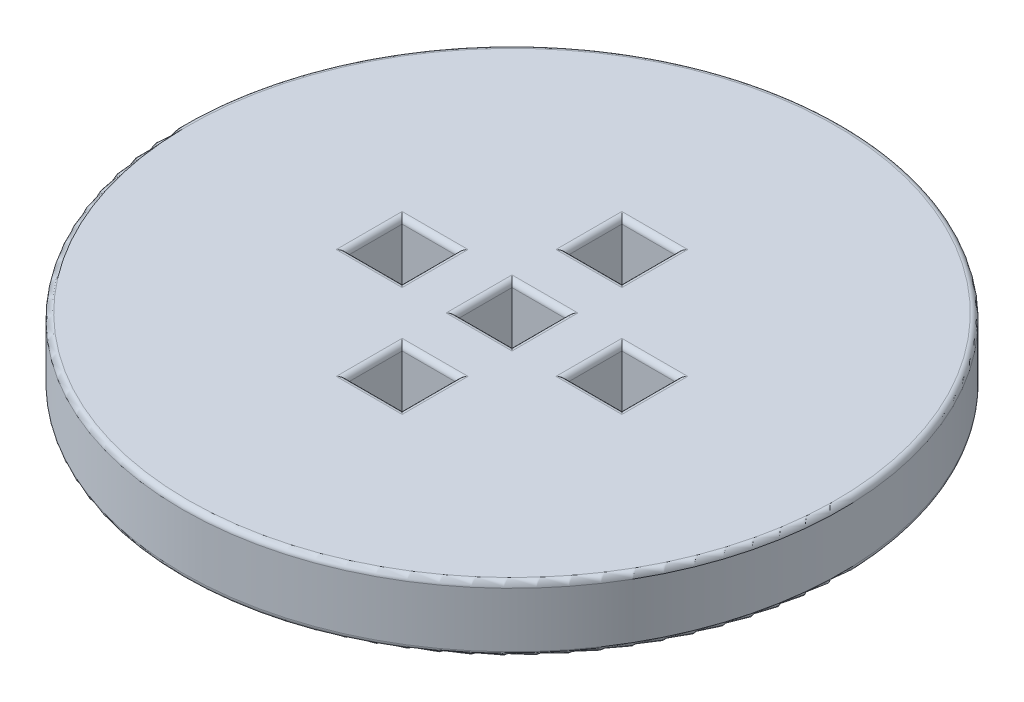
ISO-10303-21;
HEADER;
FILE_DESCRIPTION(('STEP AP214'),'2;1');
FILE_NAME('part.step','',(''),(''),'','','');
FILE_SCHEMA(('AUTOMOTIVE_DESIGN { 1 0 10303 214 1 1 1 1 }'));
ENDSEC;
DATA;
#1=APPLICATION_CONTEXT('core data for automotive mechanical design processes');
#2=APPLICATION_PROTOCOL_DEFINITION('international standard','automotive_design',2000,#1);
#3=PRODUCT_CONTEXT('',#1,'mechanical');
#4=PRODUCT('Part','Part','',(#3));
#5=PRODUCT_RELATED_PRODUCT_CATEGORY('part','',(#4));
#6=PRODUCT_DEFINITION_FORMATION('','',#4);
#7=PRODUCT_DEFINITION_CONTEXT('part definition',#1,'design');
#8=PRODUCT_DEFINITION('design','',#6,#7);
#9=PRODUCT_DEFINITION_SHAPE('','',#8);
#10=(LENGTH_UNIT() NAMED_UNIT(*) SI_UNIT(.MILLI.,.METRE.));
#11=(NAMED_UNIT(*) PLANE_ANGLE_UNIT() SI_UNIT($,.RADIAN.));
#12=(NAMED_UNIT(*) SI_UNIT($,.STERADIAN.) SOLID_ANGLE_UNIT());
#13=UNCERTAINTY_MEASURE_WITH_UNIT(LENGTH_MEASURE(1.E-05),#10,'distance_accuracy_value','');
#14=(GEOMETRIC_REPRESENTATION_CONTEXT(3) GLOBAL_UNCERTAINTY_ASSIGNED_CONTEXT((#13)) GLOBAL_UNIT_ASSIGNED_CONTEXT((#10,
#11,#12)) REPRESENTATION_CONTEXT('',''));
#15=CARTESIAN_POINT('',(0.,0.,0.));
#16=DIRECTION('',(0.,0.,1.));
#17=DIRECTION('',(1.,0.,0.));
#18=AXIS2_PLACEMENT_3D('',#15,#16,#17);
#19=CARTESIAN_POINT('',(0.,6.,0.));
#20=DIRECTION('',(0.,-1.,0.));
#21=DIRECTION('',(0.,0.,-1.));
#22=AXIS2_PLACEMENT_3D('',#19,#20,#21);
#23=CYLINDRICAL_SURFACE('',#22,30.);
#24=CARTESIAN_POINT('',(0.,5.5,0.));
#25=DIRECTION('',(0.,1.,0.));
#26=DIRECTION('',(0.,0.,1.));
#27=AXIS2_PLACEMENT_3D('',#24,#25,#26);
#28=CIRCLE('',#27,30.);
#29=CARTESIAN_POINT('',(0.,5.5,30.));
#30=VERTEX_POINT('',#29);
#31=EDGE_CURVE('E432',#30,#30,#28,.F.);
#32=ORIENTED_EDGE('',*,*,#31,.T.);
#33=EDGE_LOOP('',(#32));
#34=FACE_BOUND('',#33,.T.);
#35=CARTESIAN_POINT('',(0.,0.5,0.));
#36=DIRECTION('',(0.,1.,0.));
#37=DIRECTION('',(0.,0.,1.));
#38=AXIS2_PLACEMENT_3D('',#35,#36,#37);
#39=CIRCLE('',#38,30.);
#40=CARTESIAN_POINT('',(0.,0.5,30.));
#41=VERTEX_POINT('',#40);
#42=EDGE_CURVE('E563',#41,#41,#39,.T.);
#43=ORIENTED_EDGE('',*,*,#42,.T.);
#44=EDGE_LOOP('',(#43));
#45=FACE_BOUND('',#44,.T.);
#46=ADVANCED_FACE('F33',(#34,#45),#23,.T.);
#47=CARTESIAN_POINT('',(0.,6.,0.));
#48=DIRECTION('',(0.,1.,0.));
#49=DIRECTION('',(0.,0.,1.));
#50=AXIS2_PLACEMENT_3D('',#47,#48,#49);
#51=PLANE('',#50);
#52=CARTESIAN_POINT('',(0.,6.,0.));
#53=DIRECTION('',(0.,1.,0.));
#54=DIRECTION('',(0.,0.,1.));
#55=AXIS2_PLACEMENT_3D('',#52,#53,#54);
#56=CIRCLE('',#55,29.5);
#57=CARTESIAN_POINT('',(0.,6.,29.5));
#58=VERTEX_POINT('',#57);
#59=EDGE_CURVE('E429',#58,#58,#56,.T.);
#60=ORIENTED_EDGE('',*,*,#59,.T.);
#61=EDGE_LOOP('',(#60));
#62=FACE_BOUND('',#61,.T.);
#63=DIRECTION('',(0.,0.,1.));
#64=VECTOR('',#63,1.);
#65=CARTESIAN_POINT('',(-3.,6.,7.5));
#66=LINE('',#65,#64);
#67=CARTESIAN_POINT('',(-3.,6.,13.));
#68=VERTEX_POINT('',#67);
#69=CARTESIAN_POINT('',(-3.,6.,7.));
#70=VERTEX_POINT('',#69);
#71=EDGE_CURVE('E424',#68,#70,#66,.F.);
#72=ORIENTED_EDGE('',*,*,#71,.T.);
#73=DIRECTION('',(-1.,0.,0.));
#74=VECTOR('',#73,1.);
#75=CARTESIAN_POINT('',(2.5,6.,7.));
#76=LINE('',#75,#74);
#77=CARTESIAN_POINT('',(3.,6.,7.));
#78=VERTEX_POINT('',#77);
#79=EDGE_CURVE('E426',#70,#78,#76,.F.);
#80=ORIENTED_EDGE('',*,*,#79,.T.);
#81=DIRECTION('',(0.,0.,-1.));
#82=VECTOR('',#81,1.);
#83=CARTESIAN_POINT('',(3.,6.,12.5));
#84=LINE('',#83,#82);
#85=CARTESIAN_POINT('',(3.,6.,13.));
#86=VERTEX_POINT('',#85);
#87=EDGE_CURVE('E420',#78,#86,#84,.F.);
#88=ORIENTED_EDGE('',*,*,#87,.T.);
#89=DIRECTION('',(1.,0.,0.));
#90=VECTOR('',#89,1.);
#91=CARTESIAN_POINT('',(-2.5,6.,13.));
#92=LINE('',#91,#90);
#93=EDGE_CURVE('E422',#86,#68,#92,.F.);
#94=ORIENTED_EDGE('',*,*,#93,.T.);
#95=EDGE_LOOP('',(#72,#80,#88,#94));
#96=FACE_BOUND('',#95,.T.);
#97=DIRECTION('',(0.,0.,1.));
#98=VECTOR('',#97,1.);
#99=CARTESIAN_POINT('',(-3.,6.,-12.5));
#100=LINE('',#99,#98);
#101=CARTESIAN_POINT('',(-3.,6.,-7.));
#102=VERTEX_POINT('',#101);
#103=CARTESIAN_POINT('',(-3.,6.,-13.));
#104=VERTEX_POINT('',#103);
#105=EDGE_CURVE('E411',#102,#104,#100,.F.);
#106=ORIENTED_EDGE('',*,*,#105,.T.);
#107=DIRECTION('',(-1.,0.,0.));
#108=VECTOR('',#107,1.);
#109=CARTESIAN_POINT('',(2.5,6.,-13.));
#110=LINE('',#109,#108);
#111=CARTESIAN_POINT('',(3.,6.,-13.));
#112=VERTEX_POINT('',#111);
#113=EDGE_CURVE('E413',#104,#112,#110,.F.);
#114=ORIENTED_EDGE('',*,*,#113,.T.);
#115=DIRECTION('',(0.,0.,-1.));
#116=VECTOR('',#115,1.);
#117=CARTESIAN_POINT('',(3.,6.,-7.5));
#118=LINE('',#117,#116);
#119=CARTESIAN_POINT('',(3.,6.,-7.));
#120=VERTEX_POINT('',#119);
#121=EDGE_CURVE('E407',#112,#120,#118,.F.);
#122=ORIENTED_EDGE('',*,*,#121,.T.);
#123=DIRECTION('',(1.,0.,0.));
#124=VECTOR('',#123,1.);
#125=CARTESIAN_POINT('',(-2.5,6.,-7.));
#126=LINE('',#125,#124);
#127=EDGE_CURVE('E409',#120,#102,#126,.F.);
#128=ORIENTED_EDGE('',*,*,#127,.T.);
#129=EDGE_LOOP('',(#106,#114,#122,#128));
#130=FACE_BOUND('',#129,.T.);
#131=DIRECTION('',(0.,0.,-1.));
#132=VECTOR('',#131,1.);
#133=CARTESIAN_POINT('',(13.,6.,2.5));
#134=LINE('',#133,#132);
#135=CARTESIAN_POINT('',(13.,6.,-3.));
#136=VERTEX_POINT('',#135);
#137=CARTESIAN_POINT('',(13.,6.,3.));
#138=VERTEX_POINT('',#137);
#139=EDGE_CURVE('E398',#136,#138,#134,.F.);
#140=ORIENTED_EDGE('',*,*,#139,.T.);
#141=DIRECTION('',(1.,0.,0.));
#142=VECTOR('',#141,1.);
#143=CARTESIAN_POINT('',(7.5,6.,3.));
#144=LINE('',#143,#142);
#145=CARTESIAN_POINT('',(7.,6.,3.));
#146=VERTEX_POINT('',#145);
#147=EDGE_CURVE('E400',#138,#146,#144,.F.);
#148=ORIENTED_EDGE('',*,*,#147,.T.);
#149=DIRECTION('',(0.,0.,1.));
#150=VECTOR('',#149,1.);
#151=CARTESIAN_POINT('',(7.,6.,-2.5));
#152=LINE('',#151,#150);
#153=CARTESIAN_POINT('',(7.,6.,-3.));
#154=VERTEX_POINT('',#153);
#155=EDGE_CURVE('E392',#146,#154,#152,.F.);
#156=ORIENTED_EDGE('',*,*,#155,.T.);
#157=DIRECTION('',(-1.,0.,0.));
#158=VECTOR('',#157,1.);
#159=CARTESIAN_POINT('',(12.5,6.,-3.));
#160=LINE('',#159,#158);
#161=EDGE_CURVE('E396',#154,#136,#160,.F.);
#162=ORIENTED_EDGE('',*,*,#161,.T.);
#163=EDGE_LOOP('',(#140,#148,#156,#162));
#164=FACE_BOUND('',#163,.T.);
#165=DIRECTION('',(1.,0.,0.));
#166=VECTOR('',#165,1.);
#167=CARTESIAN_POINT('',(-12.5,6.,3.));
#168=LINE('',#167,#166);
#169=CARTESIAN_POINT('',(-7.,6.,3.));
#170=VERTEX_POINT('',#169);
#171=CARTESIAN_POINT('',(-13.,6.,3.));
#172=VERTEX_POINT('',#171);
#173=EDGE_CURVE('E504',#170,#172,#168,.F.);
#174=ORIENTED_EDGE('',*,*,#173,.T.);
#175=DIRECTION('',(0.,0.,1.));
#176=VECTOR('',#175,1.);
#177=CARTESIAN_POINT('',(-13.,6.,-2.5));
#178=LINE('',#177,#176);
#179=CARTESIAN_POINT('',(-13.,6.,-3.));
#180=VERTEX_POINT('',#179);
#181=EDGE_CURVE('E511',#172,#180,#178,.F.);
#182=ORIENTED_EDGE('',*,*,#181,.T.);
#183=DIRECTION('',(-1.,0.,0.));
#184=VECTOR('',#183,1.);
#185=CARTESIAN_POINT('',(-7.5,6.,-3.));
#186=LINE('',#185,#184);
#187=CARTESIAN_POINT('',(-7.,6.,-3.));
#188=VERTEX_POINT('',#187);
#189=EDGE_CURVE('E322',#180,#188,#186,.F.);
#190=ORIENTED_EDGE('',*,*,#189,.T.);
#191=DIRECTION('',(0.,0.,-1.));
#192=VECTOR('',#191,1.);
#193=CARTESIAN_POINT('',(-7.,6.,2.5));
#194=LINE('',#193,#192);
#195=EDGE_CURVE('E545',#188,#170,#194,.F.);
#196=ORIENTED_EDGE('',*,*,#195,.T.);
#197=EDGE_LOOP('',(#174,#182,#190,#196));
#198=FACE_BOUND('',#197,.T.);
#199=DIRECTION('',(1.,0.,0.));
#200=VECTOR('',#199,1.);
#201=CARTESIAN_POINT('',(-2.5,6.,3.));
#202=LINE('',#201,#200);
#203=CARTESIAN_POINT('',(3.,6.,3.));
#204=VERTEX_POINT('',#203);
#205=CARTESIAN_POINT('',(-3.,6.,3.));
#206=VERTEX_POINT('',#205);
#207=EDGE_CURVE('E507',#204,#206,#202,.F.);
#208=ORIENTED_EDGE('',*,*,#207,.T.);
#209=DIRECTION('',(0.,0.,1.));
#210=VECTOR('',#209,1.);
#211=CARTESIAN_POINT('',(-3.,6.,-2.5));
#212=LINE('',#211,#210);
#213=CARTESIAN_POINT('',(-3.,6.,-3.));
#214=VERTEX_POINT('',#213);
#215=EDGE_CURVE('E418',#206,#214,#212,.F.);
#216=ORIENTED_EDGE('',*,*,#215,.T.);
#217=DIRECTION('',(-1.,0.,0.));
#218=VECTOR('',#217,1.);
#219=CARTESIAN_POINT('',(3.,6.,-3.));
#220=LINE('',#219,#218);
#221=CARTESIAN_POINT('',(3.,6.,-3.));
#222=VERTEX_POINT('',#221);
#223=EDGE_CURVE('E416',#214,#222,#220,.F.);
#224=ORIENTED_EDGE('',*,*,#223,.T.);
#225=DIRECTION('',(0.,0.,-1.));
#226=VECTOR('',#225,1.);
#227=CARTESIAN_POINT('',(3.,6.,2.5));
#228=LINE('',#227,#226);
#229=EDGE_CURVE('E299',#222,#204,#228,.F.);
#230=ORIENTED_EDGE('',*,*,#229,.T.);
#231=EDGE_LOOP('',(#208,#216,#224,#230));
#232=FACE_BOUND('',#231,.T.);
#233=ADVANCED_FACE('F491',(#62,#96,#130,#164,#198,#232),#51,.T.);
#234=CARTESIAN_POINT('',(0.,0.,0.));
#235=DIRECTION('',(0.,1.,0.));
#236=DIRECTION('',(0.,0.,1.));
#237=AXIS2_PLACEMENT_3D('',#234,#235,#236);
#238=PLANE('',#237);
#239=CARTESIAN_POINT('',(0.,0.,0.));
#240=DIRECTION('',(0.,1.,0.));
#241=DIRECTION('',(0.,0.,1.));
#242=AXIS2_PLACEMENT_3D('',#239,#240,#241);
#243=CIRCLE('',#242,29.5);
#244=CARTESIAN_POINT('',(0.,0.,29.5));
#245=VERTEX_POINT('',#244);
#246=EDGE_CURVE('E626',#245,#245,#243,.F.);
#247=ORIENTED_EDGE('',*,*,#246,.T.);
#248=EDGE_LOOP('',(#247));
#249=FACE_BOUND('',#248,.T.);
#250=DIRECTION('',(-1.,0.,0.));
#251=VECTOR('',#250,1.);
#252=CARTESIAN_POINT('',(0.,0.,3.));
#253=LINE('',#252,#251);
#254=CARTESIAN_POINT('',(-3.,0.,3.));
#255=VERTEX_POINT('',#254);
#256=CARTESIAN_POINT('',(3.,0.,3.));
#257=VERTEX_POINT('',#256);
#258=EDGE_CURVE('E621',#255,#257,#253,.F.);
#259=ORIENTED_EDGE('',*,*,#258,.T.);
#260=DIRECTION('',(0.,0.,1.));
#261=VECTOR('',#260,1.);
#262=CARTESIAN_POINT('',(3.,0.,0.));
#263=LINE('',#262,#261);
#264=CARTESIAN_POINT('',(3.,0.,-3.));
#265=VERTEX_POINT('',#264);
#266=EDGE_CURVE('E623',#257,#265,#263,.F.);
#267=ORIENTED_EDGE('',*,*,#266,.T.);
#268=DIRECTION('',(1.,0.,0.));
#269=VECTOR('',#268,1.);
#270=CARTESIAN_POINT('',(0.,0.,-3.));
#271=LINE('',#270,#269);
#272=CARTESIAN_POINT('',(-3.,0.,-3.));
#273=VERTEX_POINT('',#272);
#274=EDGE_CURVE('E617',#265,#273,#271,.F.);
#275=ORIENTED_EDGE('',*,*,#274,.T.);
#276=DIRECTION('',(0.,0.,-1.));
#277=VECTOR('',#276,1.);
#278=CARTESIAN_POINT('',(-3.,0.,0.));
#279=LINE('',#278,#277);
#280=EDGE_CURVE('E619',#273,#255,#279,.F.);
#281=ORIENTED_EDGE('',*,*,#280,.T.);
#282=EDGE_LOOP('',(#259,#267,#275,#281));
#283=FACE_BOUND('',#282,.T.);
#284=DIRECTION('',(-1.,0.,0.));
#285=VECTOR('',#284,1.);
#286=CARTESIAN_POINT('',(0.,0.,13.));
#287=LINE('',#286,#285);
#288=CARTESIAN_POINT('',(-3.,0.,13.));
#289=VERTEX_POINT('',#288);
#290=CARTESIAN_POINT('',(3.,0.,13.));
#291=VERTEX_POINT('',#290);
#292=EDGE_CURVE('E612',#289,#291,#287,.F.);
#293=ORIENTED_EDGE('',*,*,#292,.T.);
#294=DIRECTION('',(0.,0.,1.));
#295=VECTOR('',#294,1.);
#296=CARTESIAN_POINT('',(3.,0.,0.));
#297=LINE('',#296,#295);
#298=CARTESIAN_POINT('',(3.,0.,7.));
#299=VERTEX_POINT('',#298);
#300=EDGE_CURVE('E614',#291,#299,#297,.F.);
#301=ORIENTED_EDGE('',*,*,#300,.T.);
#302=DIRECTION('',(1.,0.,0.));
#303=VECTOR('',#302,1.);
#304=CARTESIAN_POINT('',(0.,0.,7.));
#305=LINE('',#304,#303);
#306=CARTESIAN_POINT('',(-3.,0.,7.));
#307=VERTEX_POINT('',#306);
#308=EDGE_CURVE('E608',#299,#307,#305,.F.);
#309=ORIENTED_EDGE('',*,*,#308,.T.);
#310=DIRECTION('',(0.,0.,-1.));
#311=VECTOR('',#310,1.);
#312=CARTESIAN_POINT('',(-3.,0.,0.));
#313=LINE('',#312,#311);
#314=EDGE_CURVE('E610',#307,#289,#313,.F.);
#315=ORIENTED_EDGE('',*,*,#314,.T.);
#316=EDGE_LOOP('',(#293,#301,#309,#315));
#317=FACE_BOUND('',#316,.T.);
#318=DIRECTION('',(-1.,0.,0.));
#319=VECTOR('',#318,1.);
#320=CARTESIAN_POINT('',(0.,0.,3.));
#321=LINE('',#320,#319);
#322=CARTESIAN_POINT('',(-13.,0.,3.));
#323=VERTEX_POINT('',#322);
#324=CARTESIAN_POINT('',(-7.,0.,3.));
#325=VERTEX_POINT('',#324);
#326=EDGE_CURVE('E603',#323,#325,#321,.F.);
#327=ORIENTED_EDGE('',*,*,#326,.T.);
#328=DIRECTION('',(0.,0.,1.));
#329=VECTOR('',#328,1.);
#330=CARTESIAN_POINT('',(-7.,0.,0.));
#331=LINE('',#330,#329);
#332=CARTESIAN_POINT('',(-7.,0.,-3.));
#333=VERTEX_POINT('',#332);
#334=EDGE_CURVE('E605',#325,#333,#331,.F.);
#335=ORIENTED_EDGE('',*,*,#334,.T.);
#336=DIRECTION('',(1.,0.,0.));
#337=VECTOR('',#336,1.);
#338=CARTESIAN_POINT('',(0.,0.,-3.));
#339=LINE('',#338,#337);
#340=CARTESIAN_POINT('',(-13.,0.,-3.));
#341=VERTEX_POINT('',#340);
#342=EDGE_CURVE('E599',#333,#341,#339,.F.);
#343=ORIENTED_EDGE('',*,*,#342,.T.);
#344=DIRECTION('',(0.,0.,-1.));
#345=VECTOR('',#344,1.);
#346=CARTESIAN_POINT('',(-13.,0.,0.));
#347=LINE('',#346,#345);
#348=EDGE_CURVE('E601',#341,#323,#347,.F.);
#349=ORIENTED_EDGE('',*,*,#348,.T.);
#350=EDGE_LOOP('',(#327,#335,#343,#349));
#351=FACE_BOUND('',#350,.T.);
#352=DIRECTION('',(-1.,0.,0.));
#353=VECTOR('',#352,1.);
#354=CARTESIAN_POINT('',(0.,0.,3.));
#355=LINE('',#354,#353);
#356=CARTESIAN_POINT('',(7.,0.,3.));
#357=VERTEX_POINT('',#356);
#358=CARTESIAN_POINT('',(13.,0.,3.));
#359=VERTEX_POINT('',#358);
#360=EDGE_CURVE('E594',#357,#359,#355,.F.);
#361=ORIENTED_EDGE('',*,*,#360,.T.);
#362=DIRECTION('',(0.,0.,1.));
#363=VECTOR('',#362,1.);
#364=CARTESIAN_POINT('',(13.,0.,0.));
#365=LINE('',#364,#363);
#366=CARTESIAN_POINT('',(13.,0.,-3.));
#367=VERTEX_POINT('',#366);
#368=EDGE_CURVE('E596',#359,#367,#365,.F.);
#369=ORIENTED_EDGE('',*,*,#368,.T.);
#370=DIRECTION('',(1.,0.,0.));
#371=VECTOR('',#370,1.);
#372=CARTESIAN_POINT('',(0.,0.,-3.));
#373=LINE('',#372,#371);
#374=CARTESIAN_POINT('',(7.,0.,-3.));
#375=VERTEX_POINT('',#374);
#376=EDGE_CURVE('E590',#367,#375,#373,.F.);
#377=ORIENTED_EDGE('',*,*,#376,.T.);
#378=DIRECTION('',(0.,0.,-1.));
#379=VECTOR('',#378,1.);
#380=CARTESIAN_POINT('',(7.,0.,0.));
#381=LINE('',#380,#379);
#382=EDGE_CURVE('E592',#375,#357,#381,.F.);
#383=ORIENTED_EDGE('',*,*,#382,.T.);
#384=EDGE_LOOP('',(#361,#369,#377,#383));
#385=FACE_BOUND('',#384,.T.);
#386=DIRECTION('',(1.,0.,0.));
#387=VECTOR('',#386,1.);
#388=CARTESIAN_POINT('',(0.,0.,-13.));
#389=LINE('',#388,#387);
#390=CARTESIAN_POINT('',(3.,0.,-13.));
#391=VERTEX_POINT('',#390);
#392=CARTESIAN_POINT('',(-3.,0.,-13.));
#393=VERTEX_POINT('',#392);
#394=EDGE_CURVE('E585',#391,#393,#389,.F.);
#395=ORIENTED_EDGE('',*,*,#394,.T.);
#396=DIRECTION('',(0.,0.,-1.));
#397=VECTOR('',#396,1.);
#398=CARTESIAN_POINT('',(-3.,0.,0.));
#399=LINE('',#398,#397);
#400=CARTESIAN_POINT('',(-3.,0.,-7.));
#401=VERTEX_POINT('',#400);
#402=EDGE_CURVE('E587',#393,#401,#399,.F.);
#403=ORIENTED_EDGE('',*,*,#402,.T.);
#404=DIRECTION('',(-1.,0.,0.));
#405=VECTOR('',#404,1.);
#406=CARTESIAN_POINT('',(0.,0.,-7.));
#407=LINE('',#406,#405);
#408=CARTESIAN_POINT('',(3.,0.,-7.));
#409=VERTEX_POINT('',#408);
#410=EDGE_CURVE('E581',#401,#409,#407,.F.);
#411=ORIENTED_EDGE('',*,*,#410,.T.);
#412=DIRECTION('',(0.,0.,1.));
#413=VECTOR('',#412,1.);
#414=CARTESIAN_POINT('',(3.,0.,0.));
#415=LINE('',#414,#413);
#416=EDGE_CURVE('E583',#409,#391,#415,.F.);
#417=ORIENTED_EDGE('',*,*,#416,.T.);
#418=EDGE_LOOP('',(#395,#403,#411,#417));
#419=FACE_BOUND('',#418,.T.);
#420=ADVANCED_FACE('F494',(#249,#283,#317,#351,#385,#419),#238,.F.);
#421=CARTESIAN_POINT('',(2.5,3.,7.5));
#422=DIRECTION('',(1.,0.,0.));
#423=DIRECTION('',(0.,0.,-1.));
#424=AXIS2_PLACEMENT_3D('',#421,#422,#423);
#425=PLANE('',#424);
#426=DIRECTION('',(0.,1.,0.));
#427=VECTOR('',#426,1.);
#428=CARTESIAN_POINT('',(2.5,3.,12.5));
#429=LINE('',#428,#427);
#430=CARTESIAN_POINT('',(2.5,0.5,12.5));
#431=VERTEX_POINT('',#430);
#432=CARTESIAN_POINT('',(2.5,5.5,12.5));
#433=VERTEX_POINT('',#432);
#434=EDGE_CURVE('E323',#431,#433,#429,.T.);
#435=ORIENTED_EDGE('',*,*,#434,.T.);
#436=DIRECTION('',(0.,0.,-1.));
#437=VECTOR('',#436,1.);
#438=CARTESIAN_POINT('',(2.5,5.5,7.5));
#439=LINE('',#438,#437);
#440=CARTESIAN_POINT('',(2.5,5.5,7.5));
#441=VERTEX_POINT('',#440);
#442=EDGE_CURVE('E337',#433,#441,#439,.T.);
#443=ORIENTED_EDGE('',*,*,#442,.T.);
#444=DIRECTION('',(0.,1.,0.));
#445=VECTOR('',#444,1.);
#446=CARTESIAN_POINT('',(2.5,3.,7.5));
#447=LINE('',#446,#445);
#448=CARTESIAN_POINT('',(2.5,0.5,7.5));
#449=VERTEX_POINT('',#448);
#450=EDGE_CURVE('E448',#449,#441,#447,.T.);
#451=ORIENTED_EDGE('',*,*,#450,.F.);
#452=DIRECTION('',(0.,0.,1.));
#453=VECTOR('',#452,1.);
#454=CARTESIAN_POINT('',(2.5,0.5,7.5));
#455=LINE('',#454,#453);
#456=EDGE_CURVE('E635',#449,#431,#455,.T.);
#457=ORIENTED_EDGE('',*,*,#456,.T.);
#458=EDGE_LOOP('',(#435,#443,#451,#457));
#459=FACE_BOUND('',#458,.T.);
#460=ADVANCED_FACE('F446',(#459),#425,.F.);
#461=CARTESIAN_POINT('',(-2.5,3.,12.5));
#462=DIRECTION('',(0.,0.,1.));
#463=DIRECTION('',(1.,0.,0.));
#464=AXIS2_PLACEMENT_3D('',#461,#462,#463);
#465=PLANE('',#464);
#466=DIRECTION('',(0.,1.,0.));
#467=VECTOR('',#466,1.);
#468=CARTESIAN_POINT('',(-2.5,3.,12.5));
#469=LINE('',#468,#467);
#470=CARTESIAN_POINT('',(-2.5,0.5,12.5));
#471=VERTEX_POINT('',#470);
#472=CARTESIAN_POINT('',(-2.5,5.5,12.5));
#473=VERTEX_POINT('',#472);
#474=EDGE_CURVE('E479',#471,#473,#469,.T.);
#475=ORIENTED_EDGE('',*,*,#474,.T.);
#476=DIRECTION('',(1.,0.,0.));
#477=VECTOR('',#476,1.);
#478=CARTESIAN_POINT('',(2.5,5.5,12.5));
#479=LINE('',#478,#477);
#480=EDGE_CURVE('E440',#473,#433,#479,.T.);
#481=ORIENTED_EDGE('',*,*,#480,.T.);
#482=ORIENTED_EDGE('',*,*,#434,.F.);
#483=DIRECTION('',(-1.,0.,0.));
#484=VECTOR('',#483,1.);
#485=CARTESIAN_POINT('',(-2.5,0.5,12.5));
#486=LINE('',#485,#484);
#487=EDGE_CURVE('E485',#431,#471,#486,.T.);
#488=ORIENTED_EDGE('',*,*,#487,.T.);
#489=EDGE_LOOP('',(#475,#481,#482,#488));
#490=FACE_BOUND('',#489,.T.);
#491=ADVANCED_FACE('F483',(#490),#465,.F.);
#492=CARTESIAN_POINT('',(-2.5,3.,7.5));
#493=DIRECTION('',(-1.,0.,0.));
#494=DIRECTION('',(0.,0.,1.));
#495=AXIS2_PLACEMENT_3D('',#492,#493,#494);
#496=PLANE('',#495);
#497=DIRECTION('',(0.,1.,0.));
#498=VECTOR('',#497,1.);
#499=CARTESIAN_POINT('',(-2.5,3.,7.5));
#500=LINE('',#499,#498);
#501=CARTESIAN_POINT('',(-2.5,0.5,7.5));
#502=VERTEX_POINT('',#501);
#503=CARTESIAN_POINT('',(-2.5,5.5,7.5));
#504=VERTEX_POINT('',#503);
#505=EDGE_CURVE('E461',#502,#504,#500,.T.);
#506=ORIENTED_EDGE('',*,*,#505,.T.);
#507=DIRECTION('',(0.,0.,1.));
#508=VECTOR('',#507,1.);
#509=CARTESIAN_POINT('',(-2.5,5.5,12.5));
#510=LINE('',#509,#508);
#511=EDGE_CURVE('E438',#504,#473,#510,.T.);
#512=ORIENTED_EDGE('',*,*,#511,.T.);
#513=ORIENTED_EDGE('',*,*,#474,.F.);
#514=DIRECTION('',(0.,0.,-1.));
#515=VECTOR('',#514,1.);
#516=CARTESIAN_POINT('',(-2.5,0.5,7.5));
#517=LINE('',#516,#515);
#518=EDGE_CURVE('E638',#471,#502,#517,.T.);
#519=ORIENTED_EDGE('',*,*,#518,.T.);
#520=EDGE_LOOP('',(#506,#512,#513,#519));
#521=FACE_BOUND('',#520,.T.);
#522=ADVANCED_FACE('F478',(#521),#496,.F.);
#523=CARTESIAN_POINT('',(-2.5,3.,7.5));
#524=DIRECTION('',(0.,0.,-1.));
#525=DIRECTION('',(-1.,0.,0.));
#526=AXIS2_PLACEMENT_3D('',#523,#524,#525);
#527=PLANE('',#526);
#528=ORIENTED_EDGE('',*,*,#450,.T.);
#529=DIRECTION('',(-1.,0.,0.));
#530=VECTOR('',#529,1.);
#531=CARTESIAN_POINT('',(-2.5,5.5,7.5));
#532=LINE('',#531,#530);
#533=EDGE_CURVE('E435',#441,#504,#532,.T.);
#534=ORIENTED_EDGE('',*,*,#533,.T.);
#535=ORIENTED_EDGE('',*,*,#505,.F.);
#536=DIRECTION('',(1.,0.,0.));
#537=VECTOR('',#536,1.);
#538=CARTESIAN_POINT('',(-2.5,0.5,7.5));
#539=LINE('',#538,#537);
#540=EDGE_CURVE('E460',#502,#449,#539,.T.);
#541=ORIENTED_EDGE('',*,*,#540,.T.);
#542=EDGE_LOOP('',(#528,#534,#535,#541));
#543=FACE_BOUND('',#542,.T.);
#544=ADVANCED_FACE('F455',(#543),#527,.F.);
#545=CARTESIAN_POINT('',(-12.5,3.,2.5));
#546=DIRECTION('',(-1.,0.,0.));
#547=DIRECTION('',(0.,0.,1.));
#548=AXIS2_PLACEMENT_3D('',#545,#546,#547);
#549=PLANE('',#548);
#550=DIRECTION('',(0.,1.,0.));
#551=VECTOR('',#550,1.);
#552=CARTESIAN_POINT('',(-12.5,3.,2.5));
#553=LINE('',#552,#551);
#554=CARTESIAN_POINT('',(-12.5,0.5,2.5));
#555=VERTEX_POINT('',#554);
#556=CARTESIAN_POINT('',(-12.5,5.5,2.5));
#557=VERTEX_POINT('',#556);
#558=EDGE_CURVE('E540',#555,#557,#553,.T.);
#559=ORIENTED_EDGE('',*,*,#558,.F.);
#560=DIRECTION('',(0.,0.,-1.));
#561=VECTOR('',#560,1.);
#562=CARTESIAN_POINT('',(-12.5,0.5,2.5));
#563=LINE('',#562,#561);
#564=CARTESIAN_POINT('',(-12.5,0.5,-2.5));
#565=VERTEX_POINT('',#564);
#566=EDGE_CURVE('E646',#555,#565,#563,.T.);
#567=ORIENTED_EDGE('',*,*,#566,.T.);
#568=DIRECTION('',(0.,1.,0.));
#569=VECTOR('',#568,1.);
#570=CARTESIAN_POINT('',(-12.5,3.,-2.5));
#571=LINE('',#570,#569);
#572=CARTESIAN_POINT('',(-12.5,5.5,-2.5));
#573=VERTEX_POINT('',#572);
#574=EDGE_CURVE('E462',#565,#573,#571,.T.);
#575=ORIENTED_EDGE('',*,*,#574,.T.);
#576=DIRECTION('',(0.,0.,1.));
#577=VECTOR('',#576,1.);
#578=CARTESIAN_POINT('',(-12.5,5.5,2.5));
#579=LINE('',#578,#577);
#580=EDGE_CURVE('E551',#573,#557,#579,.T.);
#581=ORIENTED_EDGE('',*,*,#580,.T.);
#582=EDGE_LOOP('',(#559,#567,#575,#581));
#583=FACE_BOUND('',#582,.T.);
#584=ADVANCED_FACE('F967',(#583),#549,.F.);
#585=CARTESIAN_POINT('',(-7.5,3.,-2.5));
#586=DIRECTION('',(0.,0.,-1.));
#587=DIRECTION('',(-1.,0.,0.));
#588=AXIS2_PLACEMENT_3D('',#585,#586,#587);
#589=PLANE('',#588);
#590=ORIENTED_EDGE('',*,*,#574,.F.);
#591=DIRECTION('',(1.,0.,0.));
#592=VECTOR('',#591,1.);
#593=CARTESIAN_POINT('',(-7.5,0.5,-2.5));
#594=LINE('',#593,#592);
#595=CARTESIAN_POINT('',(-7.5,0.5,-2.5));
#596=VERTEX_POINT('',#595);
#597=EDGE_CURVE('E648',#565,#596,#594,.T.);
#598=ORIENTED_EDGE('',*,*,#597,.T.);
#599=DIRECTION('',(0.,1.,0.));
#600=VECTOR('',#599,1.);
#601=CARTESIAN_POINT('',(-7.5,3.,-2.5));
#602=LINE('',#601,#600);
#603=CARTESIAN_POINT('',(-7.5,5.5,-2.5));
#604=VERTEX_POINT('',#603);
#605=EDGE_CURVE('E536',#596,#604,#602,.T.);
#606=ORIENTED_EDGE('',*,*,#605,.T.);
#607=DIRECTION('',(-1.,0.,0.));
#608=VECTOR('',#607,1.);
#609=CARTESIAN_POINT('',(-12.5,5.5,-2.5));
#610=LINE('',#609,#608);
#611=EDGE_CURVE('E560',#604,#573,#610,.T.);
#612=ORIENTED_EDGE('',*,*,#611,.T.);
#613=EDGE_LOOP('',(#590,#598,#606,#612));
#614=FACE_BOUND('',#613,.T.);
#615=ADVANCED_FACE('F963',(#614),#589,.F.);
#616=CARTESIAN_POINT('',(-7.5,3.,2.5));
#617=DIRECTION('',(1.,0.,0.));
#618=DIRECTION('',(0.,0.,-1.));
#619=AXIS2_PLACEMENT_3D('',#616,#617,#618);
#620=PLANE('',#619);
#621=ORIENTED_EDGE('',*,*,#605,.F.);
#622=DIRECTION('',(0.,0.,1.));
#623=VECTOR('',#622,1.);
#624=CARTESIAN_POINT('',(-7.5,0.5,2.5));
#625=LINE('',#624,#623);
#626=CARTESIAN_POINT('',(-7.5,0.5,2.5));
#627=VERTEX_POINT('',#626);
#628=EDGE_CURVE('E641',#596,#627,#625,.T.);
#629=ORIENTED_EDGE('',*,*,#628,.T.);
#630=DIRECTION('',(0.,1.,0.));
#631=VECTOR('',#630,1.);
#632=CARTESIAN_POINT('',(-7.5,3.,2.5));
#633=LINE('',#632,#631);
#634=CARTESIAN_POINT('',(-7.5,5.5,2.5));
#635=VERTEX_POINT('',#634);
#636=EDGE_CURVE('E538',#627,#635,#633,.T.);
#637=ORIENTED_EDGE('',*,*,#636,.T.);
#638=DIRECTION('',(0.,0.,-1.));
#639=VECTOR('',#638,1.);
#640=CARTESIAN_POINT('',(-7.5,5.5,-2.5));
#641=LINE('',#640,#639);
#642=EDGE_CURVE('E557',#635,#604,#641,.T.);
#643=ORIENTED_EDGE('',*,*,#642,.T.);
#644=EDGE_LOOP('',(#621,#629,#637,#643));
#645=FACE_BOUND('',#644,.T.);
#646=ADVANCED_FACE('F966',(#645),#620,.F.);
#647=CARTESIAN_POINT('',(-7.5,3.,2.5));
#648=DIRECTION('',(0.,0.,1.));
#649=DIRECTION('',(1.,0.,0.));
#650=AXIS2_PLACEMENT_3D('',#647,#648,#649);
#651=PLANE('',#650);
#652=ORIENTED_EDGE('',*,*,#636,.F.);
#653=DIRECTION('',(-1.,0.,0.));
#654=VECTOR('',#653,1.);
#655=CARTESIAN_POINT('',(-7.5,0.5,2.5));
#656=LINE('',#655,#654);
#657=EDGE_CURVE('E644',#627,#555,#656,.T.);
#658=ORIENTED_EDGE('',*,*,#657,.T.);
#659=ORIENTED_EDGE('',*,*,#558,.T.);
#660=DIRECTION('',(1.,0.,0.));
#661=VECTOR('',#660,1.);
#662=CARTESIAN_POINT('',(-7.5,5.5,2.5));
#663=LINE('',#662,#661);
#664=EDGE_CURVE('E554',#557,#635,#663,.T.);
#665=ORIENTED_EDGE('',*,*,#664,.T.);
#666=EDGE_LOOP('',(#652,#658,#659,#665));
#667=FACE_BOUND('',#666,.T.);
#668=ADVANCED_FACE('F962',(#667),#651,.F.);
#669=CARTESIAN_POINT('',(-2.5,3.,2.5));
#670=DIRECTION('',(-1.,0.,0.));
#671=DIRECTION('',(0.,0.,1.));
#672=AXIS2_PLACEMENT_3D('',#669,#670,#671);
#673=PLANE('',#672);
#674=DIRECTION('',(0.,1.,0.));
#675=VECTOR('',#674,1.);
#676=CARTESIAN_POINT('',(-2.5,3.,-2.5));
#677=LINE('',#676,#675);
#678=CARTESIAN_POINT('',(-2.5,0.5,-2.5));
#679=VERTEX_POINT('',#678);
#680=CARTESIAN_POINT('',(-2.5,5.5,-2.5));
#681=VERTEX_POINT('',#680);
#682=EDGE_CURVE('E316',#679,#681,#677,.T.);
#683=ORIENTED_EDGE('',*,*,#682,.T.);
#684=DIRECTION('',(0.,0.,1.));
#685=VECTOR('',#684,1.);
#686=CARTESIAN_POINT('',(-2.5,5.5,3.));
#687=LINE('',#686,#685);
#688=CARTESIAN_POINT('',(-2.5,5.5,2.5));
#689=VERTEX_POINT('',#688);
#690=EDGE_CURVE('E331',#681,#689,#687,.T.);
#691=ORIENTED_EDGE('',*,*,#690,.T.);
#692=DIRECTION('',(0.,1.,0.));
#693=VECTOR('',#692,1.);
#694=CARTESIAN_POINT('',(-2.5,3.,2.5));
#695=LINE('',#694,#693);
#696=CARTESIAN_POINT('',(-2.5,0.5,2.5));
#697=VERTEX_POINT('',#696);
#698=EDGE_CURVE('E522',#697,#689,#695,.T.);
#699=ORIENTED_EDGE('',*,*,#698,.F.);
#700=DIRECTION('',(0.,0.,-1.));
#701=VECTOR('',#700,1.);
#702=CARTESIAN_POINT('',(-2.5,0.5,2.5));
#703=LINE('',#702,#701);
#704=EDGE_CURVE('E632',#697,#679,#703,.T.);
#705=ORIENTED_EDGE('',*,*,#704,.T.);
#706=EDGE_LOOP('',(#683,#691,#699,#705));
#707=FACE_BOUND('',#706,.T.);
#708=ADVANCED_FACE('F521',(#707),#673,.F.);
#709=CARTESIAN_POINT('',(2.5,3.,-2.5));
#710=DIRECTION('',(0.,0.,-1.));
#711=DIRECTION('',(-1.,0.,0.));
#712=AXIS2_PLACEMENT_3D('',#709,#710,#711);
#713=PLANE('',#712);
#714=DIRECTION('',(0.,1.,0.));
#715=VECTOR('',#714,1.);
#716=CARTESIAN_POINT('',(2.5,3.,-2.5));
#717=LINE('',#716,#715);
#718=CARTESIAN_POINT('',(2.5,0.5,-2.5));
#719=VERTEX_POINT('',#718);
#720=CARTESIAN_POINT('',(2.5,5.5,-2.5));
#721=VERTEX_POINT('',#720);
#722=EDGE_CURVE('E306',#719,#721,#717,.T.);
#723=ORIENTED_EDGE('',*,*,#722,.T.);
#724=DIRECTION('',(-1.,0.,0.));
#725=VECTOR('',#724,1.);
#726=CARTESIAN_POINT('',(-2.5,5.5,-2.5));
#727=LINE('',#726,#725);
#728=EDGE_CURVE('E309',#721,#681,#727,.T.);
#729=ORIENTED_EDGE('',*,*,#728,.T.);
#730=ORIENTED_EDGE('',*,*,#682,.F.);
#731=DIRECTION('',(1.,0.,0.));
#732=VECTOR('',#731,1.);
#733=CARTESIAN_POINT('',(2.5,0.5,-2.5));
#734=LINE('',#733,#732);
#735=EDGE_CURVE('E312',#679,#719,#734,.T.);
#736=ORIENTED_EDGE('',*,*,#735,.T.);
#737=EDGE_LOOP('',(#723,#729,#730,#736));
#738=FACE_BOUND('',#737,.T.);
#739=ADVANCED_FACE('F307',(#738),#713,.F.);
#740=CARTESIAN_POINT('',(2.5,3.,2.5));
#741=DIRECTION('',(1.,0.,0.));
#742=DIRECTION('',(0.,0.,-1.));
#743=AXIS2_PLACEMENT_3D('',#740,#741,#742);
#744=PLANE('',#743);
#745=ORIENTED_EDGE('',*,*,#722,.F.);
#746=DIRECTION('',(0.,0.,1.));
#747=VECTOR('',#746,1.);
#748=CARTESIAN_POINT('',(2.5,0.5,2.5));
#749=LINE('',#748,#747);
#750=CARTESIAN_POINT('',(2.5,0.5,2.5));
#751=VERTEX_POINT('',#750);
#752=EDGE_CURVE('E629',#719,#751,#749,.T.);
#753=ORIENTED_EDGE('',*,*,#752,.T.);
#754=DIRECTION('',(0.,1.,0.));
#755=VECTOR('',#754,1.);
#756=CARTESIAN_POINT('',(2.5,3.,2.5));
#757=LINE('',#756,#755);
#758=CARTESIAN_POINT('',(2.5,5.5,2.5));
#759=VERTEX_POINT('',#758);
#760=EDGE_CURVE('E317',#751,#759,#757,.T.);
#761=ORIENTED_EDGE('',*,*,#760,.T.);
#762=DIRECTION('',(0.,0.,-1.));
#763=VECTOR('',#762,1.);
#764=CARTESIAN_POINT('',(2.5,5.5,-2.5));
#765=LINE('',#764,#763);
#766=EDGE_CURVE('E298',#759,#721,#765,.T.);
#767=ORIENTED_EDGE('',*,*,#766,.T.);
#768=EDGE_LOOP('',(#745,#753,#761,#767));
#769=FACE_BOUND('',#768,.T.);
#770=ADVANCED_FACE('F319',(#769),#744,.F.);
#771=CARTESIAN_POINT('',(2.5,3.,2.5));
#772=DIRECTION('',(0.,0.,1.));
#773=DIRECTION('',(1.,0.,0.));
#774=AXIS2_PLACEMENT_3D('',#771,#772,#773);
#775=PLANE('',#774);
#776=ORIENTED_EDGE('',*,*,#760,.F.);
#777=DIRECTION('',(-1.,0.,0.));
#778=VECTOR('',#777,1.);
#779=CARTESIAN_POINT('',(2.5,0.5,2.5));
#780=LINE('',#779,#778);
#781=EDGE_CURVE('E527',#751,#697,#780,.T.);
#782=ORIENTED_EDGE('',*,*,#781,.T.);
#783=ORIENTED_EDGE('',*,*,#698,.T.);
#784=DIRECTION('',(1.,0.,0.));
#785=VECTOR('',#784,1.);
#786=CARTESIAN_POINT('',(2.5,5.5,2.5));
#787=LINE('',#786,#785);
#788=EDGE_CURVE('E515',#689,#759,#787,.T.);
#789=ORIENTED_EDGE('',*,*,#788,.T.);
#790=EDGE_LOOP('',(#776,#782,#783,#789));
#791=FACE_BOUND('',#790,.T.);
#792=ADVANCED_FACE('F525',(#791),#775,.F.);
#793=CARTESIAN_POINT('',(2.5,3.,-12.5));
#794=DIRECTION('',(1.,0.,0.));
#795=DIRECTION('',(0.,0.,-1.));
#796=AXIS2_PLACEMENT_3D('',#793,#794,#795);
#797=PLANE('',#796);
#798=DIRECTION('',(0.,1.,0.));
#799=VECTOR('',#798,1.);
#800=CARTESIAN_POINT('',(2.5,3.,-7.5));
#801=LINE('',#800,#799);
#802=CARTESIAN_POINT('',(2.5,0.5,-7.5));
#803=VERTEX_POINT('',#802);
#804=CARTESIAN_POINT('',(2.5,5.5,-7.5));
#805=VERTEX_POINT('',#804);
#806=EDGE_CURVE('E528',#803,#805,#801,.T.);
#807=ORIENTED_EDGE('',*,*,#806,.T.);
#808=DIRECTION('',(0.,0.,-1.));
#809=VECTOR('',#808,1.);
#810=CARTESIAN_POINT('',(2.5,5.5,-12.5));
#811=LINE('',#810,#809);
#812=CARTESIAN_POINT('',(2.5,5.5,-12.5));
#813=VERTEX_POINT('',#812);
#814=EDGE_CURVE('E344',#805,#813,#811,.T.);
#815=ORIENTED_EDGE('',*,*,#814,.T.);
#816=DIRECTION('',(0.,1.,0.));
#817=VECTOR('',#816,1.);
#818=CARTESIAN_POINT('',(2.5,3.,-12.5));
#819=LINE('',#818,#817);
#820=CARTESIAN_POINT('',(2.5,0.5,-12.5));
#821=VERTEX_POINT('',#820);
#822=EDGE_CURVE('E746',#821,#813,#819,.T.);
#823=ORIENTED_EDGE('',*,*,#822,.F.);
#824=DIRECTION('',(0.,0.,1.));
#825=VECTOR('',#824,1.);
#826=CARTESIAN_POINT('',(2.5,0.5,-12.5));
#827=LINE('',#826,#825);
#828=EDGE_CURVE('E664',#821,#803,#827,.T.);
#829=ORIENTED_EDGE('',*,*,#828,.T.);
#830=EDGE_LOOP('',(#807,#815,#823,#829));
#831=FACE_BOUND('',#830,.T.);
#832=ADVANCED_FACE('F937',(#831),#797,.F.);
#833=CARTESIAN_POINT('',(-2.5,3.,-7.5));
#834=DIRECTION('',(0.,0.,1.));
#835=DIRECTION('',(1.,0.,0.));
#836=AXIS2_PLACEMENT_3D('',#833,#834,#835);
#837=PLANE('',#836);
#838=DIRECTION('',(0.,1.,0.));
#839=VECTOR('',#838,1.);
#840=CARTESIAN_POINT('',(-2.5,3.,-7.5));
#841=LINE('',#840,#839);
#842=CARTESIAN_POINT('',(-2.5,0.5,-7.5));
#843=VERTEX_POINT('',#842);
#844=CARTESIAN_POINT('',(-2.5,5.5,-7.5));
#845=VERTEX_POINT('',#844);
#846=EDGE_CURVE('E532',#843,#845,#841,.T.);
#847=ORIENTED_EDGE('',*,*,#846,.T.);
#848=DIRECTION('',(1.,0.,0.));
#849=VECTOR('',#848,1.);
#850=CARTESIAN_POINT('',(2.5,5.5,-7.5));
#851=LINE('',#850,#849);
#852=EDGE_CURVE('E342',#845,#805,#851,.T.);
#853=ORIENTED_EDGE('',*,*,#852,.T.);
#854=ORIENTED_EDGE('',*,*,#806,.F.);
#855=DIRECTION('',(-1.,0.,0.));
#856=VECTOR('',#855,1.);
#857=CARTESIAN_POINT('',(-2.5,0.5,-7.5));
#858=LINE('',#857,#856);
#859=EDGE_CURVE('E402',#803,#843,#858,.T.);
#860=ORIENTED_EDGE('',*,*,#859,.T.);
#861=EDGE_LOOP('',(#847,#853,#854,#860));
#862=FACE_BOUND('',#861,.T.);
#863=ADVANCED_FACE('F940',(#862),#837,.F.);
#864=CARTESIAN_POINT('',(-2.5,3.,-12.5));
#865=DIRECTION('',(-1.,0.,0.));
#866=DIRECTION('',(0.,0.,1.));
#867=AXIS2_PLACEMENT_3D('',#864,#865,#866);
#868=PLANE('',#867);
#869=DIRECTION('',(0.,1.,0.));
#870=VECTOR('',#869,1.);
#871=CARTESIAN_POINT('',(-2.5,3.,-12.5));
#872=LINE('',#871,#870);
#873=CARTESIAN_POINT('',(-2.5,0.5,-12.5));
#874=VERTEX_POINT('',#873);
#875=CARTESIAN_POINT('',(-2.5,5.5,-12.5));
#876=VERTEX_POINT('',#875);
#877=EDGE_CURVE('E742',#874,#876,#872,.T.);
#878=ORIENTED_EDGE('',*,*,#877,.T.);
#879=DIRECTION('',(0.,0.,1.));
#880=VECTOR('',#879,1.);
#881=CARTESIAN_POINT('',(-2.5,5.5,-7.5));
#882=LINE('',#881,#880);
#883=EDGE_CURVE('E334',#876,#845,#882,.T.);
#884=ORIENTED_EDGE('',*,*,#883,.T.);
#885=ORIENTED_EDGE('',*,*,#846,.F.);
#886=DIRECTION('',(0.,0.,-1.));
#887=VECTOR('',#886,1.);
#888=CARTESIAN_POINT('',(-2.5,0.5,-12.5));
#889=LINE('',#888,#887);
#890=EDGE_CURVE('E659',#843,#874,#889,.T.);
#891=ORIENTED_EDGE('',*,*,#890,.T.);
#892=EDGE_LOOP('',(#878,#884,#885,#891));
#893=FACE_BOUND('',#892,.T.);
#894=ADVANCED_FACE('F741',(#893),#868,.F.);
#895=CARTESIAN_POINT('',(-2.5,3.,-12.5));
#896=DIRECTION('',(0.,0.,-1.));
#897=DIRECTION('',(-1.,0.,0.));
#898=AXIS2_PLACEMENT_3D('',#895,#896,#897);
#899=PLANE('',#898);
#900=ORIENTED_EDGE('',*,*,#822,.T.);
#901=DIRECTION('',(-1.,0.,0.));
#902=VECTOR('',#901,1.);
#903=CARTESIAN_POINT('',(-2.5,5.5,-12.5));
#904=LINE('',#903,#902);
#905=EDGE_CURVE('E330',#813,#876,#904,.T.);
#906=ORIENTED_EDGE('',*,*,#905,.T.);
#907=ORIENTED_EDGE('',*,*,#877,.F.);
#908=DIRECTION('',(1.,0.,0.));
#909=VECTOR('',#908,1.);
#910=CARTESIAN_POINT('',(-2.5,0.5,-12.5));
#911=LINE('',#910,#909);
#912=EDGE_CURVE('E662',#874,#821,#911,.T.);
#913=ORIENTED_EDGE('',*,*,#912,.T.);
#914=EDGE_LOOP('',(#900,#906,#907,#913));
#915=FACE_BOUND('',#914,.T.);
#916=ADVANCED_FACE('F744',(#915),#899,.F.);
#917=CARTESIAN_POINT('',(7.5,3.,2.5));
#918=DIRECTION('',(-1.,0.,0.));
#919=DIRECTION('',(0.,0.,1.));
#920=AXIS2_PLACEMENT_3D('',#917,#918,#919);
#921=PLANE('',#920);
#922=DIRECTION('',(0.,1.,0.));
#923=VECTOR('',#922,1.);
#924=CARTESIAN_POINT('',(7.5,3.,-2.5));
#925=LINE('',#924,#923);
#926=CARTESIAN_POINT('',(7.5,0.5,-2.5));
#927=VERTEX_POINT('',#926);
#928=CARTESIAN_POINT('',(7.5,5.5,-2.5));
#929=VERTEX_POINT('',#928);
#930=EDGE_CURVE('E749',#927,#929,#925,.T.);
#931=ORIENTED_EDGE('',*,*,#930,.T.);
#932=DIRECTION('',(0.,0.,1.));
#933=VECTOR('',#932,1.);
#934=CARTESIAN_POINT('',(7.5,5.5,2.5));
#935=LINE('',#934,#933);
#936=CARTESIAN_POINT('',(7.5,5.5,2.5));
#937=VERTEX_POINT('',#936);
#938=EDGE_CURVE('E351',#929,#937,#935,.T.);
#939=ORIENTED_EDGE('',*,*,#938,.T.);
#940=DIRECTION('',(0.,1.,0.));
#941=VECTOR('',#940,1.);
#942=CARTESIAN_POINT('',(7.5,3.,2.5));
#943=LINE('',#942,#941);
#944=CARTESIAN_POINT('',(7.5,0.5,2.5));
#945=VERTEX_POINT('',#944);
#946=EDGE_CURVE('E566',#945,#937,#943,.T.);
#947=ORIENTED_EDGE('',*,*,#946,.F.);
#948=DIRECTION('',(0.,0.,-1.));
#949=VECTOR('',#948,1.);
#950=CARTESIAN_POINT('',(7.5,0.5,2.5));
#951=LINE('',#950,#949);
#952=EDGE_CURVE('E655',#945,#927,#951,.T.);
#953=ORIENTED_EDGE('',*,*,#952,.T.);
#954=EDGE_LOOP('',(#931,#939,#947,#953));
#955=FACE_BOUND('',#954,.T.);
#956=ADVANCED_FACE('F760',(#955),#921,.F.);
#957=CARTESIAN_POINT('',(12.5,3.,-2.5));
#958=DIRECTION('',(0.,0.,-1.));
#959=DIRECTION('',(-1.,0.,0.));
#960=AXIS2_PLACEMENT_3D('',#957,#958,#959);
#961=PLANE('',#960);
#962=DIRECTION('',(0.,1.,0.));
#963=VECTOR('',#962,1.);
#964=CARTESIAN_POINT('',(12.5,3.,-2.5));
#965=LINE('',#964,#963);
#966=CARTESIAN_POINT('',(12.5,0.5,-2.5));
#967=VERTEX_POINT('',#966);
#968=CARTESIAN_POINT('',(12.5,5.5,-2.5));
#969=VERTEX_POINT('',#968);
#970=EDGE_CURVE('E757',#967,#969,#965,.T.);
#971=ORIENTED_EDGE('',*,*,#970,.T.);
#972=DIRECTION('',(-1.,0.,0.));
#973=VECTOR('',#972,1.);
#974=CARTESIAN_POINT('',(7.5,5.5,-2.5));
#975=LINE('',#974,#973);
#976=EDGE_CURVE('E50',#969,#929,#975,.T.);
#977=ORIENTED_EDGE('',*,*,#976,.T.);
#978=ORIENTED_EDGE('',*,*,#930,.F.);
#979=DIRECTION('',(1.,0.,0.));
#980=VECTOR('',#979,1.);
#981=CARTESIAN_POINT('',(12.5,0.5,-2.5));
#982=LINE('',#981,#980);
#983=EDGE_CURVE('E657',#927,#967,#982,.T.);
#984=ORIENTED_EDGE('',*,*,#983,.T.);
#985=EDGE_LOOP('',(#971,#977,#978,#984));
#986=FACE_BOUND('',#985,.T.);
#987=ADVANCED_FACE('F764',(#986),#961,.F.);
#988=CARTESIAN_POINT('',(12.5,3.,2.5));
#989=DIRECTION('',(1.,0.,0.));
#990=DIRECTION('',(0.,0.,-1.));
#991=AXIS2_PLACEMENT_3D('',#988,#989,#990);
#992=PLANE('',#991);
#993=DIRECTION('',(0.,1.,0.));
#994=VECTOR('',#993,1.);
#995=CARTESIAN_POINT('',(12.5,3.,2.5));
#996=LINE('',#995,#994);
#997=CARTESIAN_POINT('',(12.5,0.5,2.5));
#998=VERTEX_POINT('',#997);
#999=CARTESIAN_POINT('',(12.5,5.5,2.5));
#1000=VERTEX_POINT('',#999);
#1001=EDGE_CURVE('E755',#998,#1000,#996,.T.);
#1002=ORIENTED_EDGE('',*,*,#1001,.T.);
#1003=DIRECTION('',(0.,0.,-1.));
#1004=VECTOR('',#1003,1.);
#1005=CARTESIAN_POINT('',(12.5,5.5,-2.5));
#1006=LINE('',#1005,#1004);
#1007=EDGE_CURVE('E58',#1000,#969,#1006,.T.);
#1008=ORIENTED_EDGE('',*,*,#1007,.T.);
#1009=ORIENTED_EDGE('',*,*,#970,.F.);
#1010=DIRECTION('',(0.,0.,1.));
#1011=VECTOR('',#1010,1.);
#1012=CARTESIAN_POINT('',(12.5,0.5,2.5));
#1013=LINE('',#1012,#1011);
#1014=EDGE_CURVE('E650',#967,#998,#1013,.T.);
#1015=ORIENTED_EDGE('',*,*,#1014,.T.);
#1016=EDGE_LOOP('',(#1002,#1008,#1009,#1015));
#1017=FACE_BOUND('',#1016,.T.);
#1018=ADVANCED_FACE('F781',(#1017),#992,.F.);
#1019=CARTESIAN_POINT('',(12.5,3.,2.5));
#1020=DIRECTION('',(0.,0.,1.));
#1021=DIRECTION('',(1.,0.,0.));
#1022=AXIS2_PLACEMENT_3D('',#1019,#1020,#1021);
#1023=PLANE('',#1022);
#1024=ORIENTED_EDGE('',*,*,#946,.T.);
#1025=DIRECTION('',(1.,0.,0.));
#1026=VECTOR('',#1025,1.);
#1027=CARTESIAN_POINT('',(12.5,5.5,2.5));
#1028=LINE('',#1027,#1026);
#1029=EDGE_CURVE('E346',#937,#1000,#1028,.T.);
#1030=ORIENTED_EDGE('',*,*,#1029,.T.);
#1031=ORIENTED_EDGE('',*,*,#1001,.F.);
#1032=DIRECTION('',(-1.,0.,0.));
#1033=VECTOR('',#1032,1.);
#1034=CARTESIAN_POINT('',(12.5,0.5,2.5));
#1035=LINE('',#1034,#1033);
#1036=EDGE_CURVE('E653',#998,#945,#1035,.T.);
#1037=ORIENTED_EDGE('',*,*,#1036,.T.);
#1038=EDGE_LOOP('',(#1024,#1030,#1031,#1037));
#1039=FACE_BOUND('',#1038,.T.);
#1040=ADVANCED_FACE('F783',(#1039),#1023,.F.);
#1041=CARTESIAN_POINT('',(2.5,5.5,3.));
#1042=DIRECTION('',(-1.,0.,0.));
#1043=DIRECTION('',(0.,0.,1.));
#1044=AXIS2_PLACEMENT_3D('',#1041,#1042,#1043);
#1045=CYLINDRICAL_SURFACE('',#1044,0.5);
#1046=ORIENTED_EDGE('',*,*,#788,.F.);
#1047=CARTESIAN_POINT('',(-3.,5.5,3.));
#1048=DIRECTION('',(-0.707106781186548,0.,-0.707106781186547));
#1049=DIRECTION('',(0.707106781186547,0.,-0.707106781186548));
#1050=AXIS2_PLACEMENT_3D('',#1047,#1048,#1049);
#1051=ELLIPSE('',#1050,0.707106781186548,0.5);
#1052=EDGE_CURVE('E42',#689,#206,#1051,.F.);
#1053=ORIENTED_EDGE('',*,*,#1052,.T.);
#1054=ORIENTED_EDGE('',*,*,#207,.F.);
#1055=CARTESIAN_POINT('',(3.,5.5,3.));
#1056=DIRECTION('',(-0.707106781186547,0.,0.707106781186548));
#1057=DIRECTION('',(0.707106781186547,0.,0.707106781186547));
#1058=AXIS2_PLACEMENT_3D('',#1055,#1056,#1057);
#1059=ELLIPSE('',#1058,0.707106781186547,0.5);
#1060=EDGE_CURVE('E564',#759,#204,#1059,.F.);
#1061=ORIENTED_EDGE('',*,*,#1060,.F.);
#1062=EDGE_LOOP('',(#1046,#1053,#1054,#1061));
#1063=FACE_BOUND('',#1062,.T.);
#1064=ADVANCED_FACE('F514',(#1063),#1045,.T.);
#1065=CARTESIAN_POINT('',(3.,5.5,2.5));
#1066=DIRECTION('',(0.,0.,1.));
#1067=DIRECTION('',(1.,0.,0.));
#1068=AXIS2_PLACEMENT_3D('',#1065,#1066,#1067);
#1069=CYLINDRICAL_SURFACE('',#1068,0.5);
#1070=ORIENTED_EDGE('',*,*,#1060,.T.);
#1071=ORIENTED_EDGE('',*,*,#229,.F.);
#1072=CARTESIAN_POINT('',(3.,5.5,-3.));
#1073=DIRECTION('',(0.707106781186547,0.,0.707106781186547));
#1074=DIRECTION('',(0.707106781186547,0.,-0.707106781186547));
#1075=AXIS2_PLACEMENT_3D('',#1072,#1073,#1074);
#1076=ELLIPSE('',#1075,0.707106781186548,0.5);
#1077=EDGE_CURVE('E11',#222,#721,#1076,.T.);
#1078=ORIENTED_EDGE('',*,*,#1077,.T.);
#1079=ORIENTED_EDGE('',*,*,#766,.F.);
#1080=EDGE_LOOP('',(#1070,#1071,#1078,#1079));
#1081=FACE_BOUND('',#1080,.T.);
#1082=ADVANCED_FACE('F296',(#1081),#1069,.T.);
#1083=CARTESIAN_POINT('',(-7.,5.5,2.5));
#1084=DIRECTION('',(0.,0.,1.));
#1085=DIRECTION('',(1.,0.,0.));
#1086=AXIS2_PLACEMENT_3D('',#1083,#1084,#1085);
#1087=CYLINDRICAL_SURFACE('',#1086,0.5);
#1088=CARTESIAN_POINT('',(-7.,5.5,3.));
#1089=DIRECTION('',(-0.707106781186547,0.,0.707106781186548));
#1090=DIRECTION('',(-0.707106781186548,0.,-0.707106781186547));
#1091=AXIS2_PLACEMENT_3D('',#1088,#1089,#1090);
#1092=ELLIPSE('',#1091,0.707106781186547,0.5);
#1093=EDGE_CURVE('E574',#170,#635,#1092,.T.);
#1094=ORIENTED_EDGE('',*,*,#1093,.F.);
#1095=ORIENTED_EDGE('',*,*,#195,.F.);
#1096=CARTESIAN_POINT('',(-7.,5.5,-3.));
#1097=DIRECTION('',(0.707106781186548,0.,0.707106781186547));
#1098=DIRECTION('',(-0.707106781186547,0.,0.707106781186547));
#1099=AXIS2_PLACEMENT_3D('',#1096,#1097,#1098);
#1100=ELLIPSE('',#1099,0.707106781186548,0.5);
#1101=EDGE_CURVE('E567',#604,#188,#1100,.F.);
#1102=ORIENTED_EDGE('',*,*,#1101,.F.);
#1103=ORIENTED_EDGE('',*,*,#642,.F.);
#1104=EDGE_LOOP('',(#1094,#1095,#1102,#1103));
#1105=FACE_BOUND('',#1104,.T.);
#1106=ADVANCED_FACE('F806',(#1105),#1087,.T.);
#1107=CARTESIAN_POINT('',(-7.5,5.5,-3.));
#1108=DIRECTION('',(1.,0.,0.));
#1109=DIRECTION('',(0.,0.,-1.));
#1110=AXIS2_PLACEMENT_3D('',#1107,#1108,#1109);
#1111=CYLINDRICAL_SURFACE('',#1110,0.5);
#1112=ORIENTED_EDGE('',*,*,#1101,.T.);
#1113=ORIENTED_EDGE('',*,*,#189,.F.);
#1114=CARTESIAN_POINT('',(-13.,5.5,-3.));
#1115=DIRECTION('',(0.707106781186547,0.,-0.707106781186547));
#1116=DIRECTION('',(-0.707106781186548,0.,-0.707106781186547));
#1117=AXIS2_PLACEMENT_3D('',#1114,#1115,#1116);
#1118=ELLIPSE('',#1117,0.707106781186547,0.5);
#1119=EDGE_CURVE('E571',#573,#180,#1118,.F.);
#1120=ORIENTED_EDGE('',*,*,#1119,.F.);
#1121=ORIENTED_EDGE('',*,*,#611,.F.);
#1122=EDGE_LOOP('',(#1112,#1113,#1120,#1121));
#1123=FACE_BOUND('',#1122,.T.);
#1124=ADVANCED_FACE('F817',(#1123),#1111,.T.);
#1125=CARTESIAN_POINT('',(-7.5,5.5,3.));
#1126=DIRECTION('',(-1.,0.,0.));
#1127=DIRECTION('',(0.,0.,1.));
#1128=AXIS2_PLACEMENT_3D('',#1125,#1126,#1127);
#1129=CYLINDRICAL_SURFACE('',#1128,0.5);
#1130=ORIENTED_EDGE('',*,*,#1093,.T.);
#1131=ORIENTED_EDGE('',*,*,#664,.F.);
#1132=CARTESIAN_POINT('',(-13.,5.5,3.));
#1133=DIRECTION('',(-0.707106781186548,0.,-0.707106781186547));
#1134=DIRECTION('',(0.707106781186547,0.,-0.707106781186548));
#1135=AXIS2_PLACEMENT_3D('',#1132,#1133,#1134);
#1136=ELLIPSE('',#1135,0.707106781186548,0.5);
#1137=EDGE_CURVE('E568',#172,#557,#1136,.T.);
#1138=ORIENTED_EDGE('',*,*,#1137,.F.);
#1139=ORIENTED_EDGE('',*,*,#173,.F.);
#1140=EDGE_LOOP('',(#1130,#1131,#1138,#1139));
#1141=FACE_BOUND('',#1140,.T.);
#1142=ADVANCED_FACE('F813',(#1141),#1129,.T.);
#1143=CARTESIAN_POINT('',(-13.,5.5,2.5));
#1144=DIRECTION('',(0.,0.,-1.));
#1145=DIRECTION('',(-1.,0.,0.));
#1146=AXIS2_PLACEMENT_3D('',#1143,#1144,#1145);
#1147=CYLINDRICAL_SURFACE('',#1146,0.5);
#1148=ORIENTED_EDGE('',*,*,#1119,.T.);
#1149=ORIENTED_EDGE('',*,*,#181,.F.);
#1150=ORIENTED_EDGE('',*,*,#1137,.T.);
#1151=ORIENTED_EDGE('',*,*,#580,.F.);
#1152=EDGE_LOOP('',(#1148,#1149,#1150,#1151));
#1153=FACE_BOUND('',#1152,.T.);
#1154=ADVANCED_FACE('F809',(#1153),#1147,.T.);
#1155=CARTESIAN_POINT('',(0.,0.5,0.));
#1156=DIRECTION('',(0.,1.,0.));
#1157=DIRECTION('',(0.,0.,1.));
#1158=AXIS2_PLACEMENT_3D('',#1155,#1156,#1157);
#1159=TOROIDAL_SURFACE('',#1158,29.5,0.5);
#1160=ORIENTED_EDGE('',*,*,#246,.F.);
#1161=EDGE_LOOP('',(#1160));
#1162=FACE_BOUND('',#1161,.T.);
#1163=ORIENTED_EDGE('',*,*,#42,.F.);
#1164=EDGE_LOOP('',(#1163));
#1165=FACE_BOUND('',#1164,.T.);
#1166=ADVANCED_FACE('F812',(#1162,#1165),#1159,.T.);
#1167=CARTESIAN_POINT('',(-3.,0.5,2.5));
#1168=DIRECTION('',(0.,0.,-1.));
#1169=DIRECTION('',(-1.,0.,0.));
#1170=AXIS2_PLACEMENT_3D('',#1167,#1168,#1169);
#1171=CYLINDRICAL_SURFACE('',#1170,0.5);
#1172=CARTESIAN_POINT('',(-3.,0.5,3.));
#1173=DIRECTION('',(-0.707106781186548,0.,-0.707106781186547));
#1174=DIRECTION('',(-0.707106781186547,0.,0.707106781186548));
#1175=AXIS2_PLACEMENT_3D('',#1172,#1173,#1174);
#1176=ELLIPSE('',#1175,0.707106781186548,0.5);
#1177=EDGE_CURVE('E672',#255,#697,#1176,.F.);
#1178=ORIENTED_EDGE('',*,*,#1177,.F.);
#1179=ORIENTED_EDGE('',*,*,#280,.F.);
#1180=CARTESIAN_POINT('',(-3.,0.5,-3.));
#1181=DIRECTION('',(0.707106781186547,0.,-0.707106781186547));
#1182=DIRECTION('',(-0.707106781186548,0.,-0.707106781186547));
#1183=AXIS2_PLACEMENT_3D('',#1180,#1181,#1182);
#1184=ELLIPSE('',#1183,0.707106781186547,0.5);
#1185=EDGE_CURVE('E572',#679,#273,#1184,.T.);
#1186=ORIENTED_EDGE('',*,*,#1185,.F.);
#1187=ORIENTED_EDGE('',*,*,#704,.F.);
#1188=EDGE_LOOP('',(#1178,#1179,#1186,#1187));
#1189=FACE_BOUND('',#1188,.T.);
#1190=ADVANCED_FACE('F827',(#1189),#1171,.T.);
#1191=CARTESIAN_POINT('',(2.5,0.5,-3.));
#1192=DIRECTION('',(1.,0.,0.));
#1193=DIRECTION('',(0.,0.,-1.));
#1194=AXIS2_PLACEMENT_3D('',#1191,#1192,#1193);
#1195=CYLINDRICAL_SURFACE('',#1194,0.5);
#1196=ORIENTED_EDGE('',*,*,#1185,.T.);
#1197=ORIENTED_EDGE('',*,*,#274,.F.);
#1198=CARTESIAN_POINT('',(3.,0.5,-3.));
#1199=DIRECTION('',(0.707106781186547,0.,0.707106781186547));
#1200=DIRECTION('',(-0.707106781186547,0.,0.707106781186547));
#1201=AXIS2_PLACEMENT_3D('',#1198,#1199,#1200);
#1202=ELLIPSE('',#1201,0.707106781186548,0.5);
#1203=EDGE_CURVE('E669',#719,#265,#1202,.T.);
#1204=ORIENTED_EDGE('',*,*,#1203,.F.);
#1205=ORIENTED_EDGE('',*,*,#735,.F.);
#1206=EDGE_LOOP('',(#1196,#1197,#1204,#1205));
#1207=FACE_BOUND('',#1206,.T.);
#1208=ADVANCED_FACE('F837',(#1207),#1195,.T.);
#1209=CARTESIAN_POINT('',(2.5,0.5,3.));
#1210=DIRECTION('',(-1.,0.,0.));
#1211=DIRECTION('',(0.,0.,1.));
#1212=AXIS2_PLACEMENT_3D('',#1209,#1210,#1211);
#1213=CYLINDRICAL_SURFACE('',#1212,0.5);
#1214=ORIENTED_EDGE('',*,*,#1177,.T.);
#1215=ORIENTED_EDGE('',*,*,#781,.F.);
#1216=CARTESIAN_POINT('',(3.,0.5,3.));
#1217=DIRECTION('',(-0.707106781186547,0.,0.707106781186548));
#1218=DIRECTION('',(0.707106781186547,0.,0.707106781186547));
#1219=AXIS2_PLACEMENT_3D('',#1216,#1217,#1218);
#1220=ELLIPSE('',#1219,0.707106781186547,0.5);
#1221=EDGE_CURVE('E667',#257,#751,#1220,.F.);
#1222=ORIENTED_EDGE('',*,*,#1221,.F.);
#1223=ORIENTED_EDGE('',*,*,#258,.F.);
#1224=EDGE_LOOP('',(#1214,#1215,#1222,#1223));
#1225=FACE_BOUND('',#1224,.T.);
#1226=ADVANCED_FACE('F833',(#1225),#1213,.T.);
#1227=CARTESIAN_POINT('',(3.,0.5,2.5));
#1228=DIRECTION('',(0.,0.,1.));
#1229=DIRECTION('',(1.,0.,0.));
#1230=AXIS2_PLACEMENT_3D('',#1227,#1228,#1229);
#1231=CYLINDRICAL_SURFACE('',#1230,0.5);
#1232=ORIENTED_EDGE('',*,*,#1203,.T.);
#1233=ORIENTED_EDGE('',*,*,#266,.F.);
#1234=ORIENTED_EDGE('',*,*,#1221,.T.);
#1235=ORIENTED_EDGE('',*,*,#752,.F.);
#1236=EDGE_LOOP('',(#1232,#1233,#1234,#1235));
#1237=FACE_BOUND('',#1236,.T.);
#1238=ADVANCED_FACE('F829',(#1237),#1231,.T.);
#1239=CARTESIAN_POINT('',(-3.,0.5,7.5));
#1240=DIRECTION('',(0.,0.,-1.));
#1241=DIRECTION('',(-1.,0.,0.));
#1242=AXIS2_PLACEMENT_3D('',#1239,#1240,#1241);
#1243=CYLINDRICAL_SURFACE('',#1242,0.5);
#1244=CARTESIAN_POINT('',(-3.,0.5,13.));
#1245=DIRECTION('',(-0.707106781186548,0.,-0.707106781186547));
#1246=DIRECTION('',(-0.707106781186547,0.,0.707106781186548));
#1247=AXIS2_PLACEMENT_3D('',#1244,#1245,#1246);
#1248=ELLIPSE('',#1247,0.707106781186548,0.5);
#1249=EDGE_CURVE('E682',#289,#471,#1248,.F.);
#1250=ORIENTED_EDGE('',*,*,#1249,.F.);
#1251=ORIENTED_EDGE('',*,*,#314,.F.);
#1252=CARTESIAN_POINT('',(-3.,0.5,7.));
#1253=DIRECTION('',(0.707106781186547,0.,-0.707106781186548));
#1254=DIRECTION('',(-0.707106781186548,0.,-0.707106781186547));
#1255=AXIS2_PLACEMENT_3D('',#1252,#1253,#1254);
#1256=ELLIPSE('',#1255,0.707106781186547,0.5);
#1257=EDGE_CURVE('E670',#502,#307,#1256,.T.);
#1258=ORIENTED_EDGE('',*,*,#1257,.F.);
#1259=ORIENTED_EDGE('',*,*,#518,.F.);
#1260=EDGE_LOOP('',(#1250,#1251,#1258,#1259));
#1261=FACE_BOUND('',#1260,.T.);
#1262=ADVANCED_FACE('F832',(#1261),#1243,.T.);
#1263=CARTESIAN_POINT('',(-2.5,0.5,7.));
#1264=DIRECTION('',(1.,0.,0.));
#1265=DIRECTION('',(0.,0.,-1.));
#1266=AXIS2_PLACEMENT_3D('',#1263,#1264,#1265);
#1267=CYLINDRICAL_SURFACE('',#1266,0.5);
#1268=ORIENTED_EDGE('',*,*,#1257,.T.);
#1269=ORIENTED_EDGE('',*,*,#308,.F.);
#1270=CARTESIAN_POINT('',(3.,0.5,7.));
#1271=DIRECTION('',(0.707106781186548,0.,0.707106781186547));
#1272=DIRECTION('',(-0.707106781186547,0.,0.707106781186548));
#1273=AXIS2_PLACEMENT_3D('',#1270,#1271,#1272);
#1274=ELLIPSE('',#1273,0.707106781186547,0.5);
#1275=EDGE_CURVE('E679',#449,#299,#1274,.T.);
#1276=ORIENTED_EDGE('',*,*,#1275,.F.);
#1277=ORIENTED_EDGE('',*,*,#540,.F.);
#1278=EDGE_LOOP('',(#1268,#1269,#1276,#1277));
#1279=FACE_BOUND('',#1278,.T.);
#1280=ADVANCED_FACE('F853',(#1279),#1267,.T.);
#1281=CARTESIAN_POINT('',(-2.5,0.5,13.));
#1282=DIRECTION('',(-1.,0.,0.));
#1283=DIRECTION('',(0.,0.,1.));
#1284=AXIS2_PLACEMENT_3D('',#1281,#1282,#1283);
#1285=CYLINDRICAL_SURFACE('',#1284,0.5);
#1286=ORIENTED_EDGE('',*,*,#1249,.T.);
#1287=ORIENTED_EDGE('',*,*,#487,.F.);
#1288=CARTESIAN_POINT('',(3.,0.5,13.));
#1289=DIRECTION('',(-0.707106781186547,0.,0.707106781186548));
#1290=DIRECTION('',(0.707106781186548,0.,0.707106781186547));
#1291=AXIS2_PLACEMENT_3D('',#1288,#1289,#1290);
#1292=ELLIPSE('',#1291,0.707106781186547,0.5);
#1293=EDGE_CURVE('E677',#291,#431,#1292,.F.);
#1294=ORIENTED_EDGE('',*,*,#1293,.F.);
#1295=ORIENTED_EDGE('',*,*,#292,.F.);
#1296=EDGE_LOOP('',(#1286,#1287,#1294,#1295));
#1297=FACE_BOUND('',#1296,.T.);
#1298=ADVANCED_FACE('F849',(#1297),#1285,.T.);
#1299=CARTESIAN_POINT('',(3.,0.5,7.5));
#1300=DIRECTION('',(0.,0.,1.));
#1301=DIRECTION('',(1.,0.,0.));
#1302=AXIS2_PLACEMENT_3D('',#1299,#1300,#1301);
#1303=CYLINDRICAL_SURFACE('',#1302,0.5);
#1304=ORIENTED_EDGE('',*,*,#1275,.T.);
#1305=ORIENTED_EDGE('',*,*,#300,.F.);
#1306=ORIENTED_EDGE('',*,*,#1293,.T.);
#1307=ORIENTED_EDGE('',*,*,#456,.F.);
#1308=EDGE_LOOP('',(#1304,#1305,#1306,#1307));
#1309=FACE_BOUND('',#1308,.T.);
#1310=ADVANCED_FACE('F845',(#1309),#1303,.T.);
#1311=CARTESIAN_POINT('',(-13.,0.5,2.5));
#1312=DIRECTION('',(0.,0.,-1.));
#1313=DIRECTION('',(-1.,0.,0.));
#1314=AXIS2_PLACEMENT_3D('',#1311,#1312,#1313);
#1315=CYLINDRICAL_SURFACE('',#1314,0.5);
#1316=CARTESIAN_POINT('',(-13.,0.5,3.));
#1317=DIRECTION('',(-0.707106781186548,0.,-0.707106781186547));
#1318=DIRECTION('',(-0.707106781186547,0.,0.707106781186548));
#1319=AXIS2_PLACEMENT_3D('',#1316,#1317,#1318);
#1320=ELLIPSE('',#1319,0.707106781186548,0.5);
#1321=EDGE_CURVE('E692',#323,#555,#1320,.F.);
#1322=ORIENTED_EDGE('',*,*,#1321,.F.);
#1323=ORIENTED_EDGE('',*,*,#348,.F.);
#1324=CARTESIAN_POINT('',(-13.,0.5,-3.));
#1325=DIRECTION('',(0.707106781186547,0.,-0.707106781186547));
#1326=DIRECTION('',(-0.707106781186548,0.,-0.707106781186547));
#1327=AXIS2_PLACEMENT_3D('',#1324,#1325,#1326);
#1328=ELLIPSE('',#1327,0.707106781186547,0.5);
#1329=EDGE_CURVE('E680',#565,#341,#1328,.T.);
#1330=ORIENTED_EDGE('',*,*,#1329,.F.);
#1331=ORIENTED_EDGE('',*,*,#566,.F.);
#1332=EDGE_LOOP('',(#1322,#1323,#1330,#1331));
#1333=FACE_BOUND('',#1332,.T.);
#1334=ADVANCED_FACE('F848',(#1333),#1315,.T.);
#1335=CARTESIAN_POINT('',(-7.5,0.5,-3.));
#1336=DIRECTION('',(1.,0.,0.));
#1337=DIRECTION('',(0.,0.,-1.));
#1338=AXIS2_PLACEMENT_3D('',#1335,#1336,#1337);
#1339=CYLINDRICAL_SURFACE('',#1338,0.5);
#1340=ORIENTED_EDGE('',*,*,#1329,.T.);
#1341=ORIENTED_EDGE('',*,*,#342,.F.);
#1342=CARTESIAN_POINT('',(-7.,0.5,-3.));
#1343=DIRECTION('',(0.707106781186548,0.,0.707106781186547));
#1344=DIRECTION('',(-0.707106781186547,0.,0.707106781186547));
#1345=AXIS2_PLACEMENT_3D('',#1342,#1343,#1344);
#1346=ELLIPSE('',#1345,0.707106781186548,0.5);
#1347=EDGE_CURVE('E689',#596,#333,#1346,.T.);
#1348=ORIENTED_EDGE('',*,*,#1347,.F.);
#1349=ORIENTED_EDGE('',*,*,#597,.F.);
#1350=EDGE_LOOP('',(#1340,#1341,#1348,#1349));
#1351=FACE_BOUND('',#1350,.T.);
#1352=ADVANCED_FACE('F868',(#1351),#1339,.T.);
#1353=CARTESIAN_POINT('',(-7.5,0.5,3.));
#1354=DIRECTION('',(-1.,0.,0.));
#1355=DIRECTION('',(0.,0.,1.));
#1356=AXIS2_PLACEMENT_3D('',#1353,#1354,#1355);
#1357=CYLINDRICAL_SURFACE('',#1356,0.5);
#1358=ORIENTED_EDGE('',*,*,#1321,.T.);
#1359=ORIENTED_EDGE('',*,*,#657,.F.);
#1360=CARTESIAN_POINT('',(-7.,0.5,3.));
#1361=DIRECTION('',(-0.707106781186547,0.,0.707106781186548));
#1362=DIRECTION('',(0.707106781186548,0.,0.707106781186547));
#1363=AXIS2_PLACEMENT_3D('',#1360,#1361,#1362);
#1364=ELLIPSE('',#1363,0.707106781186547,0.5);
#1365=EDGE_CURVE('E687',#325,#627,#1364,.F.);
#1366=ORIENTED_EDGE('',*,*,#1365,.F.);
#1367=ORIENTED_EDGE('',*,*,#326,.F.);
#1368=EDGE_LOOP('',(#1358,#1359,#1366,#1367));
#1369=FACE_BOUND('',#1368,.T.);
#1370=ADVANCED_FACE('F864',(#1369),#1357,.T.);
#1371=CARTESIAN_POINT('',(-7.,0.5,2.5));
#1372=DIRECTION('',(0.,0.,1.));
#1373=DIRECTION('',(1.,0.,0.));
#1374=AXIS2_PLACEMENT_3D('',#1371,#1372,#1373);
#1375=CYLINDRICAL_SURFACE('',#1374,0.5);
#1376=ORIENTED_EDGE('',*,*,#1347,.T.);
#1377=ORIENTED_EDGE('',*,*,#334,.F.);
#1378=ORIENTED_EDGE('',*,*,#1365,.T.);
#1379=ORIENTED_EDGE('',*,*,#628,.F.);
#1380=EDGE_LOOP('',(#1376,#1377,#1378,#1379));
#1381=FACE_BOUND('',#1380,.T.);
#1382=ADVANCED_FACE('F861',(#1381),#1375,.T.);
#1383=CARTESIAN_POINT('',(7.,0.5,2.5));
#1384=DIRECTION('',(0.,0.,-1.));
#1385=DIRECTION('',(-1.,0.,0.));
#1386=AXIS2_PLACEMENT_3D('',#1383,#1384,#1385);
#1387=CYLINDRICAL_SURFACE('',#1386,0.5);
#1388=CARTESIAN_POINT('',(7.,0.5,3.));
#1389=DIRECTION('',(-0.707106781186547,0.,-0.707106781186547));
#1390=DIRECTION('',(-0.707106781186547,0.,0.707106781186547));
#1391=AXIS2_PLACEMENT_3D('',#1388,#1389,#1390);
#1392=ELLIPSE('',#1391,0.707106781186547,0.5);
#1393=EDGE_CURVE('E702',#357,#945,#1392,.F.);
#1394=ORIENTED_EDGE('',*,*,#1393,.F.);
#1395=ORIENTED_EDGE('',*,*,#382,.F.);
#1396=CARTESIAN_POINT('',(7.,0.5,-3.));
#1397=DIRECTION('',(0.707106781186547,0.,-0.707106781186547));
#1398=DIRECTION('',(-0.707106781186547,0.,-0.707106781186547));
#1399=AXIS2_PLACEMENT_3D('',#1396,#1397,#1398);
#1400=ELLIPSE('',#1399,0.707106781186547,0.5);
#1401=EDGE_CURVE('E690',#927,#375,#1400,.T.);
#1402=ORIENTED_EDGE('',*,*,#1401,.F.);
#1403=ORIENTED_EDGE('',*,*,#952,.F.);
#1404=EDGE_LOOP('',(#1394,#1395,#1402,#1403));
#1405=FACE_BOUND('',#1404,.T.);
#1406=ADVANCED_FACE('F769',(#1405),#1387,.T.);
#1407=CARTESIAN_POINT('',(12.5,0.5,-3.));
#1408=DIRECTION('',(1.,0.,0.));
#1409=DIRECTION('',(0.,0.,-1.));
#1410=AXIS2_PLACEMENT_3D('',#1407,#1408,#1409);
#1411=CYLINDRICAL_SURFACE('',#1410,0.5);
#1412=ORIENTED_EDGE('',*,*,#1401,.T.);
#1413=ORIENTED_EDGE('',*,*,#376,.F.);
#1414=CARTESIAN_POINT('',(13.,0.5,-3.));
#1415=DIRECTION('',(0.707106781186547,0.,0.707106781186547));
#1416=DIRECTION('',(-0.707106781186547,0.,0.707106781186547));
#1417=AXIS2_PLACEMENT_3D('',#1414,#1415,#1416);
#1418=ELLIPSE('',#1417,0.707106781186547,0.5);
#1419=EDGE_CURVE('E699',#967,#367,#1418,.T.);
#1420=ORIENTED_EDGE('',*,*,#1419,.F.);
#1421=ORIENTED_EDGE('',*,*,#983,.F.);
#1422=EDGE_LOOP('',(#1412,#1413,#1420,#1421));
#1423=FACE_BOUND('',#1422,.T.);
#1424=ADVANCED_FACE('F773',(#1423),#1411,.T.);
#1425=CARTESIAN_POINT('',(12.5,0.5,3.));
#1426=DIRECTION('',(-1.,0.,0.));
#1427=DIRECTION('',(0.,0.,1.));
#1428=AXIS2_PLACEMENT_3D('',#1425,#1426,#1427);
#1429=CYLINDRICAL_SURFACE('',#1428,0.5);
#1430=ORIENTED_EDGE('',*,*,#1393,.T.);
#1431=ORIENTED_EDGE('',*,*,#1036,.F.);
#1432=CARTESIAN_POINT('',(13.,0.5,3.));
#1433=DIRECTION('',(-0.707106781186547,0.,0.707106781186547));
#1434=DIRECTION('',(0.707106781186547,0.,0.707106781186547));
#1435=AXIS2_PLACEMENT_3D('',#1432,#1433,#1434);
#1436=ELLIPSE('',#1435,0.707106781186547,0.5);
#1437=EDGE_CURVE('E697',#359,#998,#1436,.F.);
#1438=ORIENTED_EDGE('',*,*,#1437,.F.);
#1439=ORIENTED_EDGE('',*,*,#360,.F.);
#1440=EDGE_LOOP('',(#1430,#1431,#1438,#1439));
#1441=FACE_BOUND('',#1440,.T.);
#1442=ADVANCED_FACE('F878',(#1441),#1429,.T.);
#1443=CARTESIAN_POINT('',(13.,0.5,2.5));
#1444=DIRECTION('',(0.,0.,1.));
#1445=DIRECTION('',(1.,0.,0.));
#1446=AXIS2_PLACEMENT_3D('',#1443,#1444,#1445);
#1447=CYLINDRICAL_SURFACE('',#1446,0.5);
#1448=ORIENTED_EDGE('',*,*,#1419,.T.);
#1449=ORIENTED_EDGE('',*,*,#368,.F.);
#1450=ORIENTED_EDGE('',*,*,#1437,.T.);
#1451=ORIENTED_EDGE('',*,*,#1014,.F.);
#1452=EDGE_LOOP('',(#1448,#1449,#1450,#1451));
#1453=FACE_BOUND('',#1452,.T.);
#1454=ADVANCED_FACE('F777',(#1453),#1447,.T.);
#1455=CARTESIAN_POINT('',(3.,0.5,-12.5));
#1456=DIRECTION('',(0.,0.,1.));
#1457=DIRECTION('',(1.,0.,0.));
#1458=AXIS2_PLACEMENT_3D('',#1455,#1456,#1457);
#1459=CYLINDRICAL_SURFACE('',#1458,0.5);
#1460=CARTESIAN_POINT('',(3.,0.5,-13.));
#1461=DIRECTION('',(0.707106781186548,0.,0.707106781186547));
#1462=DIRECTION('',(0.707106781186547,0.,-0.707106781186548));
#1463=AXIS2_PLACEMENT_3D('',#1460,#1461,#1462);
#1464=ELLIPSE('',#1463,0.707106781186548,0.5);
#1465=EDGE_CURVE('E710',#391,#821,#1464,.F.);
#1466=ORIENTED_EDGE('',*,*,#1465,.F.);
#1467=ORIENTED_EDGE('',*,*,#416,.F.);
#1468=CARTESIAN_POINT('',(3.,0.5,-7.));
#1469=DIRECTION('',(-0.707106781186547,0.,0.707106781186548));
#1470=DIRECTION('',(0.707106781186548,0.,0.707106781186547));
#1471=AXIS2_PLACEMENT_3D('',#1468,#1469,#1470);
#1472=ELLIPSE('',#1471,0.707106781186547,0.5);
#1473=EDGE_CURVE('E700',#803,#409,#1472,.T.);
#1474=ORIENTED_EDGE('',*,*,#1473,.F.);
#1475=ORIENTED_EDGE('',*,*,#828,.F.);
#1476=EDGE_LOOP('',(#1466,#1467,#1474,#1475));
#1477=FACE_BOUND('',#1476,.T.);
#1478=ADVANCED_FACE('F723',(#1477),#1459,.T.);
#1479=CARTESIAN_POINT('',(-2.5,0.5,-7.));
#1480=DIRECTION('',(-1.,0.,0.));
#1481=DIRECTION('',(0.,0.,1.));
#1482=AXIS2_PLACEMENT_3D('',#1479,#1480,#1481);
#1483=CYLINDRICAL_SURFACE('',#1482,0.5);
#1484=ORIENTED_EDGE('',*,*,#1473,.T.);
#1485=ORIENTED_EDGE('',*,*,#410,.F.);
#1486=CARTESIAN_POINT('',(-3.,0.5,-7.));
#1487=DIRECTION('',(-0.707106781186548,0.,-0.707106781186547));
#1488=DIRECTION('',(0.707106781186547,0.,-0.707106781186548));
#1489=AXIS2_PLACEMENT_3D('',#1486,#1487,#1488);
#1490=ELLIPSE('',#1489,0.707106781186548,0.5);
#1491=EDGE_CURVE('E708',#843,#401,#1490,.T.);
#1492=ORIENTED_EDGE('',*,*,#1491,.F.);
#1493=ORIENTED_EDGE('',*,*,#859,.F.);
#1494=EDGE_LOOP('',(#1484,#1485,#1492,#1493));
#1495=FACE_BOUND('',#1494,.T.);
#1496=ADVANCED_FACE('F717',(#1495),#1483,.T.);
#1497=CARTESIAN_POINT('',(-2.5,0.5,-13.));
#1498=DIRECTION('',(1.,0.,0.));
#1499=DIRECTION('',(0.,0.,-1.));
#1500=AXIS2_PLACEMENT_3D('',#1497,#1498,#1499);
#1501=CYLINDRICAL_SURFACE('',#1500,0.5);
#1502=ORIENTED_EDGE('',*,*,#1465,.T.);
#1503=ORIENTED_EDGE('',*,*,#912,.F.);
#1504=CARTESIAN_POINT('',(-3.,0.5,-13.));
#1505=DIRECTION('',(0.707106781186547,0.,-0.707106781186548));
#1506=DIRECTION('',(-0.707106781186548,0.,-0.707106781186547));
#1507=AXIS2_PLACEMENT_3D('',#1504,#1505,#1506);
#1508=ELLIPSE('',#1507,0.707106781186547,0.5);
#1509=EDGE_CURVE('E365',#393,#874,#1508,.F.);
#1510=ORIENTED_EDGE('',*,*,#1509,.F.);
#1511=ORIENTED_EDGE('',*,*,#394,.F.);
#1512=EDGE_LOOP('',(#1502,#1503,#1510,#1511));
#1513=FACE_BOUND('',#1512,.T.);
#1514=ADVANCED_FACE('F733',(#1513),#1501,.T.);
#1515=CARTESIAN_POINT('',(-3.,0.5,-12.5));
#1516=DIRECTION('',(0.,0.,-1.));
#1517=DIRECTION('',(-1.,0.,0.));
#1518=AXIS2_PLACEMENT_3D('',#1515,#1516,#1517);
#1519=CYLINDRICAL_SURFACE('',#1518,0.5);
#1520=ORIENTED_EDGE('',*,*,#1491,.T.);
#1521=ORIENTED_EDGE('',*,*,#402,.F.);
#1522=ORIENTED_EDGE('',*,*,#1509,.T.);
#1523=ORIENTED_EDGE('',*,*,#890,.F.);
#1524=EDGE_LOOP('',(#1520,#1521,#1522,#1523));
#1525=FACE_BOUND('',#1524,.T.);
#1526=ADVANCED_FACE('F729',(#1525),#1519,.T.);
#1527=CARTESIAN_POINT('',(0.,5.5,0.));
#1528=DIRECTION('',(0.,1.,0.));
#1529=DIRECTION('',(0.,0.,1.));
#1530=AXIS2_PLACEMENT_3D('',#1527,#1528,#1529);
#1531=TOROIDAL_SURFACE('',#1530,29.5,0.5);
#1532=ORIENTED_EDGE('',*,*,#31,.F.);
#1533=EDGE_LOOP('',(#1532));
#1534=FACE_BOUND('',#1533,.T.);
#1535=ORIENTED_EDGE('',*,*,#59,.F.);
#1536=EDGE_LOOP('',(#1535));
#1537=FACE_BOUND('',#1536,.T.);
#1538=ADVANCED_FACE('F888',(#1534,#1537),#1531,.T.);
#1539=CARTESIAN_POINT('',(-2.5,5.5,13.));
#1540=DIRECTION('',(-1.,0.,0.));
#1541=DIRECTION('',(0.,0.,1.));
#1542=AXIS2_PLACEMENT_3D('',#1539,#1540,#1541);
#1543=CYLINDRICAL_SURFACE('',#1542,0.5);
#1544=CARTESIAN_POINT('',(-3.,5.5,13.));
#1545=DIRECTION('',(-0.707106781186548,0.,-0.707106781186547));
#1546=DIRECTION('',(0.707106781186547,0.,-0.707106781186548));
#1547=AXIS2_PLACEMENT_3D('',#1544,#1545,#1546);
#1548=ELLIPSE('',#1547,0.707106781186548,0.5);
#1549=EDGE_CURVE('E359',#68,#473,#1548,.T.);
#1550=ORIENTED_EDGE('',*,*,#1549,.F.);
#1551=ORIENTED_EDGE('',*,*,#93,.F.);
#1552=CARTESIAN_POINT('',(3.,5.5,13.));
#1553=DIRECTION('',(-0.707106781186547,0.,0.707106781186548));
#1554=DIRECTION('',(-0.707106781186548,0.,-0.707106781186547));
#1555=AXIS2_PLACEMENT_3D('',#1552,#1553,#1554);
#1556=ELLIPSE('',#1555,0.707106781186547,0.5);
#1557=EDGE_CURVE('E362',#433,#86,#1556,.F.);
#1558=ORIENTED_EDGE('',*,*,#1557,.F.);
#1559=ORIENTED_EDGE('',*,*,#480,.F.);
#1560=EDGE_LOOP('',(#1550,#1551,#1558,#1559));
#1561=FACE_BOUND('',#1560,.T.);
#1562=ADVANCED_FACE('F488',(#1561),#1543,.T.);
#1563=CARTESIAN_POINT('',(3.,5.5,7.5));
#1564=DIRECTION('',(0.,0.,1.));
#1565=DIRECTION('',(1.,0.,0.));
#1566=AXIS2_PLACEMENT_3D('',#1563,#1564,#1565);
#1567=CYLINDRICAL_SURFACE('',#1566,0.5);
#1568=ORIENTED_EDGE('',*,*,#1557,.T.);
#1569=ORIENTED_EDGE('',*,*,#87,.F.);
#1570=CARTESIAN_POINT('',(3.,5.5,7.));
#1571=DIRECTION('',(0.707106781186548,0.,0.707106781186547));
#1572=DIRECTION('',(0.707106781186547,0.,-0.707106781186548));
#1573=AXIS2_PLACEMENT_3D('',#1570,#1571,#1572);
#1574=ELLIPSE('',#1573,0.707106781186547,0.5);
#1575=EDGE_CURVE('E357',#441,#78,#1574,.F.);
#1576=ORIENTED_EDGE('',*,*,#1575,.F.);
#1577=ORIENTED_EDGE('',*,*,#442,.F.);
#1578=EDGE_LOOP('',(#1568,#1569,#1576,#1577));
#1579=FACE_BOUND('',#1578,.T.);
#1580=ADVANCED_FACE('F465',(#1579),#1567,.T.);
#1581=CARTESIAN_POINT('',(-3.,5.5,7.5));
#1582=DIRECTION('',(0.,0.,-1.));
#1583=DIRECTION('',(-1.,0.,0.));
#1584=AXIS2_PLACEMENT_3D('',#1581,#1582,#1583);
#1585=CYLINDRICAL_SURFACE('',#1584,0.5);
#1586=ORIENTED_EDGE('',*,*,#1549,.T.);
#1587=ORIENTED_EDGE('',*,*,#511,.F.);
#1588=CARTESIAN_POINT('',(-3.,5.5,7.));
#1589=DIRECTION('',(0.707106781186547,0.,-0.707106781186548));
#1590=DIRECTION('',(0.707106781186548,0.,0.707106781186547));
#1591=AXIS2_PLACEMENT_3D('',#1588,#1589,#1590);
#1592=ELLIPSE('',#1591,0.707106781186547,0.5);
#1593=EDGE_CURVE('E355',#70,#504,#1592,.T.);
#1594=ORIENTED_EDGE('',*,*,#1593,.F.);
#1595=ORIENTED_EDGE('',*,*,#71,.F.);
#1596=EDGE_LOOP('',(#1586,#1587,#1594,#1595));
#1597=FACE_BOUND('',#1596,.T.);
#1598=ADVANCED_FACE('F473',(#1597),#1585,.T.);
#1599=CARTESIAN_POINT('',(-2.5,5.5,7.));
#1600=DIRECTION('',(1.,0.,0.));
#1601=DIRECTION('',(0.,0.,-1.));
#1602=AXIS2_PLACEMENT_3D('',#1599,#1600,#1601);
#1603=CYLINDRICAL_SURFACE('',#1602,0.5);
#1604=ORIENTED_EDGE('',*,*,#1575,.T.);
#1605=ORIENTED_EDGE('',*,*,#79,.F.);
#1606=ORIENTED_EDGE('',*,*,#1593,.T.);
#1607=ORIENTED_EDGE('',*,*,#533,.F.);
#1608=EDGE_LOOP('',(#1604,#1605,#1606,#1607));
#1609=FACE_BOUND('',#1608,.T.);
#1610=ADVANCED_FACE('F468',(#1609),#1603,.T.);
#1611=CARTESIAN_POINT('',(2.5,5.5,-3.));
#1612=DIRECTION('',(1.,0.,0.));
#1613=DIRECTION('',(0.,0.,-1.));
#1614=AXIS2_PLACEMENT_3D('',#1611,#1612,#1613);
#1615=CYLINDRICAL_SURFACE('',#1614,0.5);
#1616=ORIENTED_EDGE('',*,*,#1077,.F.);
#1617=ORIENTED_EDGE('',*,*,#223,.F.);
#1618=CARTESIAN_POINT('',(-3.,5.5,-3.));
#1619=DIRECTION('',(0.707106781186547,0.,-0.707106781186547));
#1620=DIRECTION('',(-0.707106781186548,0.,-0.707106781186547));
#1621=AXIS2_PLACEMENT_3D('',#1618,#1619,#1620);
#1622=ELLIPSE('',#1621,0.707106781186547,0.5);
#1623=EDGE_CURVE('E328',#681,#214,#1622,.F.);
#1624=ORIENTED_EDGE('',*,*,#1623,.F.);
#1625=ORIENTED_EDGE('',*,*,#728,.F.);
#1626=EDGE_LOOP('',(#1616,#1617,#1624,#1625));
#1627=FACE_BOUND('',#1626,.T.);
#1628=ADVANCED_FACE('F326',(#1627),#1615,.T.);
#1629=CARTESIAN_POINT('',(-3.,5.5,2.5));
#1630=DIRECTION('',(0.,0.,-1.));
#1631=DIRECTION('',(-1.,0.,0.));
#1632=AXIS2_PLACEMENT_3D('',#1629,#1630,#1631);
#1633=CYLINDRICAL_SURFACE('',#1632,0.5);
#1634=ORIENTED_EDGE('',*,*,#1623,.T.);
#1635=ORIENTED_EDGE('',*,*,#215,.F.);
#1636=ORIENTED_EDGE('',*,*,#1052,.F.);
#1637=ORIENTED_EDGE('',*,*,#690,.F.);
#1638=EDGE_LOOP('',(#1634,#1635,#1636,#1637));
#1639=FACE_BOUND('',#1638,.T.);
#1640=ADVANCED_FACE('F517',(#1639),#1633,.T.);
#1641=CARTESIAN_POINT('',(-2.5,5.5,-7.));
#1642=DIRECTION('',(-1.,0.,0.));
#1643=DIRECTION('',(0.,0.,1.));
#1644=AXIS2_PLACEMENT_3D('',#1641,#1642,#1643);
#1645=CYLINDRICAL_SURFACE('',#1644,0.5);
#1646=CARTESIAN_POINT('',(-3.,5.5,-7.));
#1647=DIRECTION('',(-0.707106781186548,0.,-0.707106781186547));
#1648=DIRECTION('',(0.707106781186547,0.,-0.707106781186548));
#1649=AXIS2_PLACEMENT_3D('',#1646,#1647,#1648);
#1650=ELLIPSE('',#1649,0.707106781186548,0.5);
#1651=EDGE_CURVE('E372',#102,#845,#1650,.T.);
#1652=ORIENTED_EDGE('',*,*,#1651,.F.);
#1653=ORIENTED_EDGE('',*,*,#127,.F.);
#1654=CARTESIAN_POINT('',(3.,5.5,-7.));
#1655=DIRECTION('',(-0.707106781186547,0.,0.707106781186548));
#1656=DIRECTION('',(-0.707106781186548,0.,-0.707106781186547));
#1657=AXIS2_PLACEMENT_3D('',#1654,#1655,#1656);
#1658=ELLIPSE('',#1657,0.707106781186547,0.5);
#1659=EDGE_CURVE('E367',#805,#120,#1658,.F.);
#1660=ORIENTED_EDGE('',*,*,#1659,.F.);
#1661=ORIENTED_EDGE('',*,*,#852,.F.);
#1662=EDGE_LOOP('',(#1652,#1653,#1660,#1661));
#1663=FACE_BOUND('',#1662,.T.);
#1664=ADVANCED_FACE('F908',(#1663),#1645,.T.);
#1665=CARTESIAN_POINT('',(3.,5.5,-12.5));
#1666=DIRECTION('',(0.,0.,1.));
#1667=DIRECTION('',(1.,0.,0.));
#1668=AXIS2_PLACEMENT_3D('',#1665,#1666,#1667);
#1669=CYLINDRICAL_SURFACE('',#1668,0.5);
#1670=ORIENTED_EDGE('',*,*,#1659,.T.);
#1671=ORIENTED_EDGE('',*,*,#121,.F.);
#1672=CARTESIAN_POINT('',(3.,5.5,-13.));
#1673=DIRECTION('',(0.707106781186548,0.,0.707106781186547));
#1674=DIRECTION('',(0.707106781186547,0.,-0.707106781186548));
#1675=AXIS2_PLACEMENT_3D('',#1672,#1673,#1674);
#1676=ELLIPSE('',#1675,0.707106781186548,0.5);
#1677=EDGE_CURVE('E370',#813,#112,#1676,.F.);
#1678=ORIENTED_EDGE('',*,*,#1677,.F.);
#1679=ORIENTED_EDGE('',*,*,#814,.F.);
#1680=EDGE_LOOP('',(#1670,#1671,#1678,#1679));
#1681=FACE_BOUND('',#1680,.T.);
#1682=ADVANCED_FACE('F918',(#1681),#1669,.T.);
#1683=CARTESIAN_POINT('',(-3.,5.5,-12.5));
#1684=DIRECTION('',(0.,0.,-1.));
#1685=DIRECTION('',(-1.,0.,0.));
#1686=AXIS2_PLACEMENT_3D('',#1683,#1684,#1685);
#1687=CYLINDRICAL_SURFACE('',#1686,0.5);
#1688=ORIENTED_EDGE('',*,*,#1651,.T.);
#1689=ORIENTED_EDGE('',*,*,#883,.F.);
#1690=CARTESIAN_POINT('',(-3.,5.5,-13.));
#1691=DIRECTION('',(0.707106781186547,0.,-0.707106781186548));
#1692=DIRECTION('',(0.707106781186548,0.,0.707106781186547));
#1693=AXIS2_PLACEMENT_3D('',#1690,#1691,#1692);
#1694=ELLIPSE('',#1693,0.707106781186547,0.5);
#1695=EDGE_CURVE('E368',#104,#876,#1694,.T.);
#1696=ORIENTED_EDGE('',*,*,#1695,.F.);
#1697=ORIENTED_EDGE('',*,*,#105,.F.);
#1698=EDGE_LOOP('',(#1688,#1689,#1696,#1697));
#1699=FACE_BOUND('',#1698,.T.);
#1700=ADVANCED_FACE('F914',(#1699),#1687,.T.);
#1701=CARTESIAN_POINT('',(-2.5,5.5,-13.));
#1702=DIRECTION('',(1.,0.,0.));
#1703=DIRECTION('',(0.,0.,-1.));
#1704=AXIS2_PLACEMENT_3D('',#1701,#1702,#1703);
#1705=CYLINDRICAL_SURFACE('',#1704,0.5);
#1706=ORIENTED_EDGE('',*,*,#1677,.T.);
#1707=ORIENTED_EDGE('',*,*,#113,.F.);
#1708=ORIENTED_EDGE('',*,*,#1695,.T.);
#1709=ORIENTED_EDGE('',*,*,#905,.F.);
#1710=EDGE_LOOP('',(#1706,#1707,#1708,#1709));
#1711=FACE_BOUND('',#1710,.T.);
#1712=ADVANCED_FACE('F911',(#1711),#1705,.T.);
#1713=CARTESIAN_POINT('',(12.5,5.5,-3.));
#1714=DIRECTION('',(1.,0.,0.));
#1715=DIRECTION('',(0.,0.,-1.));
#1716=AXIS2_PLACEMENT_3D('',#1713,#1714,#1715);
#1717=CYLINDRICAL_SURFACE('',#1716,0.5);
#1718=CARTESIAN_POINT('',(13.,5.5,-3.));
#1719=DIRECTION('',(0.707106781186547,0.,0.707106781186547));
#1720=DIRECTION('',(-0.707106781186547,0.,0.707106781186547));
#1721=AXIS2_PLACEMENT_3D('',#1718,#1719,#1720);
#1722=ELLIPSE('',#1721,0.707106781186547,0.5);
#1723=EDGE_CURVE('E380',#136,#969,#1722,.T.);
#1724=ORIENTED_EDGE('',*,*,#1723,.F.);
#1725=ORIENTED_EDGE('',*,*,#161,.F.);
#1726=CARTESIAN_POINT('',(7.,5.5,-3.));
#1727=DIRECTION('',(0.707106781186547,0.,-0.707106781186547));
#1728=DIRECTION('',(0.707106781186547,0.,0.707106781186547));
#1729=AXIS2_PLACEMENT_3D('',#1726,#1727,#1728);
#1730=ELLIPSE('',#1729,0.707106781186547,0.5);
#1731=EDGE_CURVE('E37',#929,#154,#1730,.F.);
#1732=ORIENTED_EDGE('',*,*,#1731,.F.);
#1733=ORIENTED_EDGE('',*,*,#976,.F.);
#1734=EDGE_LOOP('',(#1724,#1725,#1732,#1733));
#1735=FACE_BOUND('',#1734,.T.);
#1736=ADVANCED_FACE('F35',(#1735),#1717,.T.);
#1737=CARTESIAN_POINT('',(7.,5.5,2.5));
#1738=DIRECTION('',(0.,0.,-1.));
#1739=DIRECTION('',(-1.,0.,0.));
#1740=AXIS2_PLACEMENT_3D('',#1737,#1738,#1739);
#1741=CYLINDRICAL_SURFACE('',#1740,0.5);
#1742=ORIENTED_EDGE('',*,*,#1731,.T.);
#1743=ORIENTED_EDGE('',*,*,#155,.F.);
#1744=CARTESIAN_POINT('',(7.,5.5,3.));
#1745=DIRECTION('',(-0.707106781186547,0.,-0.707106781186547));
#1746=DIRECTION('',(-0.707106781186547,0.,0.707106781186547));
#1747=AXIS2_PLACEMENT_3D('',#1744,#1745,#1746);
#1748=ELLIPSE('',#1747,0.707106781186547,0.5);
#1749=EDGE_CURVE('E379',#937,#146,#1748,.F.);
#1750=ORIENTED_EDGE('',*,*,#1749,.F.);
#1751=ORIENTED_EDGE('',*,*,#938,.F.);
#1752=EDGE_LOOP('',(#1742,#1743,#1750,#1751));
#1753=FACE_BOUND('',#1752,.T.);
#1754=ADVANCED_FACE('F390',(#1753),#1741,.T.);
#1755=CARTESIAN_POINT('',(13.,5.5,2.5));
#1756=DIRECTION('',(0.,0.,1.));
#1757=DIRECTION('',(1.,0.,0.));
#1758=AXIS2_PLACEMENT_3D('',#1755,#1756,#1757);
#1759=CYLINDRICAL_SURFACE('',#1758,0.5);
#1760=ORIENTED_EDGE('',*,*,#1723,.T.);
#1761=ORIENTED_EDGE('',*,*,#1007,.F.);
#1762=CARTESIAN_POINT('',(13.,5.5,3.));
#1763=DIRECTION('',(-0.707106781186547,0.,0.707106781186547));
#1764=DIRECTION('',(-0.707106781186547,0.,-0.707106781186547));
#1765=AXIS2_PLACEMENT_3D('',#1762,#1763,#1764);
#1766=ELLIPSE('',#1765,0.707106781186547,0.5);
#1767=EDGE_CURVE('E377',#138,#1000,#1766,.T.);
#1768=ORIENTED_EDGE('',*,*,#1767,.F.);
#1769=ORIENTED_EDGE('',*,*,#139,.F.);
#1770=EDGE_LOOP('',(#1760,#1761,#1768,#1769));
#1771=FACE_BOUND('',#1770,.T.);
#1772=ADVANCED_FACE('F788',(#1771),#1759,.T.);
#1773=CARTESIAN_POINT('',(12.5,5.5,3.));
#1774=DIRECTION('',(-1.,0.,0.));
#1775=DIRECTION('',(0.,0.,1.));
#1776=AXIS2_PLACEMENT_3D('',#1773,#1774,#1775);
#1777=CYLINDRICAL_SURFACE('',#1776,0.5);
#1778=ORIENTED_EDGE('',*,*,#1749,.T.);
#1779=ORIENTED_EDGE('',*,*,#147,.F.);
#1780=ORIENTED_EDGE('',*,*,#1767,.T.);
#1781=ORIENTED_EDGE('',*,*,#1029,.F.);
#1782=EDGE_LOOP('',(#1778,#1779,#1780,#1781));
#1783=FACE_BOUND('',#1782,.T.);
#1784=ADVANCED_FACE('F786',(#1783),#1777,.T.);
#1785=CLOSED_SHELL('',(#46,#233,#420,#460,#491,#522,#544,#584,#615,#646,#668,#708,#739,#770,
#792,#832,#863,#894,#916,#956,#987,#1018,#1040,#1064,#1082,#1106,#1124,#1142,#1154,#1166,#1190,
#1208,#1226,#1238,#1262,#1280,#1298,#1310,#1334,#1352,#1370,#1382,#1406,#1424,#1442,#1454,#1478,
#1496,#1514,#1526,#1538,#1562,#1580,#1598,#1610,#1628,#1640,#1664,#1682,#1700,#1712,#1736,#1754,
#1772,#1784));
#1786=MANIFOLD_SOLID_BREP('B2',#1785);
#1787=ADVANCED_BREP_SHAPE_REPRESENTATION('',(#18,#1786),#14);
#1788=SHAPE_DEFINITION_REPRESENTATION(#9,#1787);
ENDSEC;
END-ISO-10303-21;
